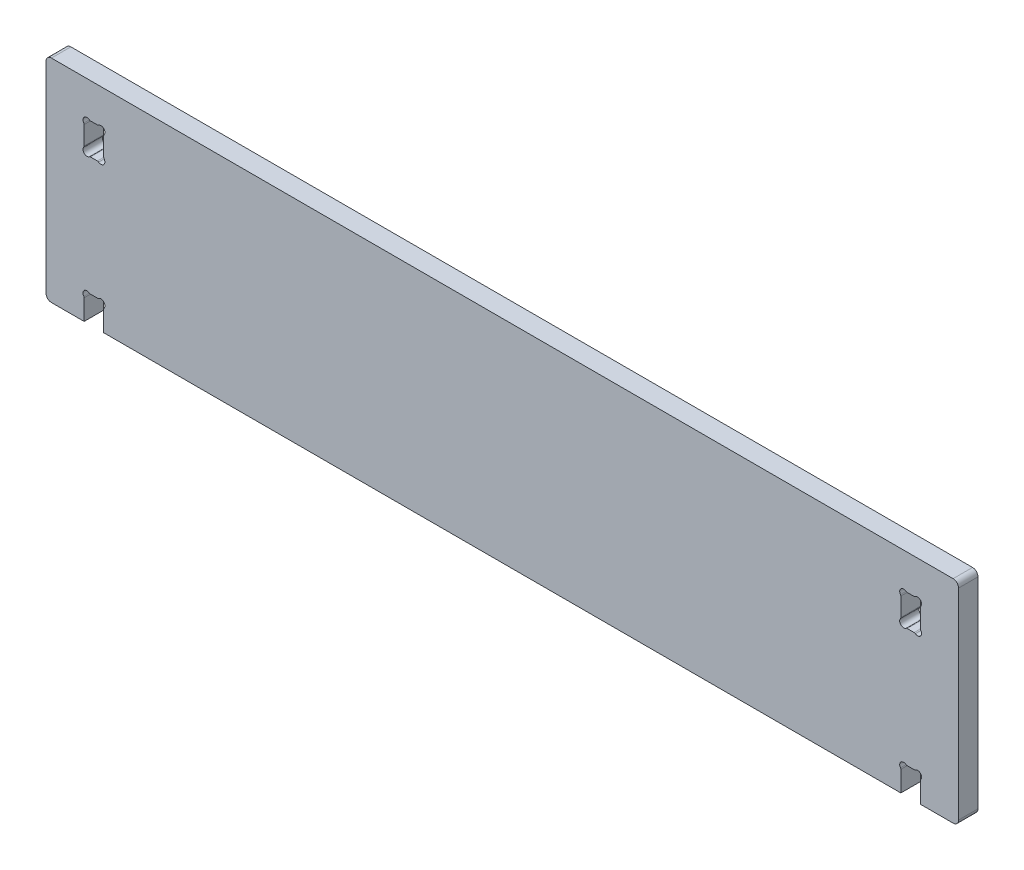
ISO-10303-21;
HEADER;
FILE_DESCRIPTION(('STEP AP214'),'2;1');
FILE_NAME('part.step','',(''),(''),'','','');
FILE_SCHEMA(('AUTOMOTIVE_DESIGN { 1 0 10303 214 1 1 1 1 }'));
ENDSEC;
DATA;
#1=APPLICATION_CONTEXT('core data for automotive mechanical design processes');
#2=APPLICATION_PROTOCOL_DEFINITION('international standard','automotive_design',2000,#1);
#3=PRODUCT_CONTEXT('',#1,'mechanical');
#4=PRODUCT('Part','Part','',(#3));
#5=PRODUCT_RELATED_PRODUCT_CATEGORY('part','',(#4));
#6=PRODUCT_DEFINITION_FORMATION('','',#4);
#7=PRODUCT_DEFINITION_CONTEXT('part definition',#1,'design');
#8=PRODUCT_DEFINITION('design','',#6,#7);
#9=PRODUCT_DEFINITION_SHAPE('','',#8);
#10=(LENGTH_UNIT() NAMED_UNIT(*) SI_UNIT(.MILLI.,.METRE.));
#11=(NAMED_UNIT(*) PLANE_ANGLE_UNIT() SI_UNIT($,.RADIAN.));
#12=(NAMED_UNIT(*) SI_UNIT($,.STERADIAN.) SOLID_ANGLE_UNIT());
#13=UNCERTAINTY_MEASURE_WITH_UNIT(LENGTH_MEASURE(1.E-05),#10,'distance_accuracy_value','');
#14=(GEOMETRIC_REPRESENTATION_CONTEXT(3) GLOBAL_UNCERTAINTY_ASSIGNED_CONTEXT((#13)) GLOBAL_UNIT_ASSIGNED_CONTEXT((#10,
#11,#12)) REPRESENTATION_CONTEXT('',''));
#15=CARTESIAN_POINT('',(0.,0.,0.));
#16=DIRECTION('',(0.,0.,1.));
#17=DIRECTION('',(1.,0.,0.));
#18=AXIS2_PLACEMENT_3D('',#15,#16,#17);
#19=CARTESIAN_POINT('',(76.7666666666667,-201.03104038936,25.));
#20=DIRECTION('',(0.,0.,-1.));
#21=DIRECTION('',(-1.,0.,0.));
#22=AXIS2_PLACEMENT_3D('',#19,#20,#21);
#23=PLANE('',#22);
#24=DIRECTION('',(0.,-1.,0.));
#25=VECTOR('',#24,1.);
#26=CARTESIAN_POINT('',(0.,-227.416666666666,25.));
#27=LINE('',#26,#25);
#28=CARTESIAN_POINT('',(0.,38.,25.));
#29=VERTEX_POINT('',#28);
#30=CARTESIAN_POINT('',(0.,-220.416666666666,25.));
#31=VERTEX_POINT('',#30);
#32=EDGE_CURVE('E797',#29,#31,#27,.T.);
#33=ORIENTED_EDGE('',*,*,#32,.T.);
#34=CARTESIAN_POINT('',(7.,-220.416666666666,25.));
#35=DIRECTION('',(0.,0.,-1.));
#36=DIRECTION('',(-1.,0.,0.));
#37=AXIS2_PLACEMENT_3D('',#34,#35,#36);
#38=CIRCLE('',#37,7.);
#39=CARTESIAN_POINT('',(7.00000000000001,-227.416666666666,25.));
#40=VERTEX_POINT('',#39);
#41=EDGE_CURVE('E41',#31,#40,#38,.F.);
#42=ORIENTED_EDGE('',*,*,#41,.T.);
#43=DIRECTION('',(1.,0.,0.));
#44=VECTOR('',#43,1.);
#45=CARTESIAN_POINT('',(49.0666666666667,-227.416666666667,25.));
#46=LINE('',#45,#44);
#47=CARTESIAN_POINT('',(49.0666666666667,-227.416666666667,25.));
#48=VERTEX_POINT('',#47);
#49=EDGE_CURVE('E772',#40,#48,#46,.T.);
#50=ORIENTED_EDGE('',*,*,#49,.T.);
#51=DIRECTION('',(0.,1.,0.));
#52=VECTOR('',#51,1.);
#53=CARTESIAN_POINT('',(49.0666666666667,-201.03104038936,25.));
#54=LINE('',#53,#52);
#55=CARTESIAN_POINT('',(49.0666666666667,-201.03104038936,25.));
#56=VERTEX_POINT('',#55);
#57=EDGE_CURVE('E774',#48,#56,#54,.T.);
#58=ORIENTED_EDGE('',*,*,#57,.T.);
#59=CARTESIAN_POINT('',(46.5666666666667,-201.03104038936,25.));
#60=DIRECTION('',(0.,0.,1.));
#61=DIRECTION('',(1.,0.,0.));
#62=AXIS2_PLACEMENT_3D('',#59,#60,#61);
#63=CIRCLE('',#62,2.5);
#64=CARTESIAN_POINT('',(48.5752997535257,-199.542620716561,25.));
#65=VERTEX_POINT('',#64);
#66=EDGE_CURVE('E777',#56,#65,#63,.T.);
#67=ORIENTED_EDGE('',*,*,#66,.T.);
#68=CARTESIAN_POINT('',(52.6729112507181,-196.506244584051,25.));
#69=DIRECTION('',(0.,0.,-1.));
#70=DIRECTION('',(-1.,0.,0.));
#71=AXIS2_PLACEMENT_3D('',#68,#69,#70);
#72=CIRCLE('',#71,5.1);
#73=CARTESIAN_POINT('',(55.7092873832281,-192.408633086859,25.));
#74=VERTEX_POINT('',#73);
#75=EDGE_CURVE('E779',#65,#74,#72,.T.);
#76=ORIENTED_EDGE('',*,*,#75,.T.);
#77=CARTESIAN_POINT('',(57.1977070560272,-190.4,25.));
#78=DIRECTION('',(0.,0.,1.));
#79=DIRECTION('',(-1.,0.,0.));
#80=AXIS2_PLACEMENT_3D('',#77,#78,#79);
#81=CIRCLE('',#80,2.49999999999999);
#82=CARTESIAN_POINT('',(57.1977070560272,-192.9,25.));
#83=VERTEX_POINT('',#82);
#84=EDGE_CURVE('E781',#74,#83,#81,.T.);
#85=ORIENTED_EDGE('',*,*,#84,.T.);
#86=DIRECTION('',(1.,0.,0.));
#87=VECTOR('',#86,1.);
#88=CARTESIAN_POINT('',(57.1977070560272,-192.9,25.));
#89=LINE('',#88,#87);
#90=CARTESIAN_POINT('',(66.1356262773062,-192.9,25.));
#91=VERTEX_POINT('',#90);
#92=EDGE_CURVE('E783',#83,#91,#89,.T.);
#93=ORIENTED_EDGE('',*,*,#92,.T.);
#94=CARTESIAN_POINT('',(66.1356262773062,-190.4,25.));
#95=DIRECTION('',(0.,0.,1.));
#96=DIRECTION('',(1.,0.,0.));
#97=AXIS2_PLACEMENT_3D('',#94,#95,#96);
#98=CIRCLE('',#97,2.49999999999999);
#99=CARTESIAN_POINT('',(67.6240459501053,-192.408633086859,25.));
#100=VERTEX_POINT('',#99);
#101=EDGE_CURVE('E785',#91,#100,#98,.T.);
#102=ORIENTED_EDGE('',*,*,#101,.T.);
#103=CARTESIAN_POINT('',(70.6604220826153,-196.506244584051,25.));
#104=DIRECTION('',(0.,0.,-1.));
#105=DIRECTION('',(1.,0.,0.));
#106=AXIS2_PLACEMENT_3D('',#103,#104,#105);
#107=CIRCLE('',#106,5.1);
#108=CARTESIAN_POINT('',(74.7580335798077,-199.542620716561,25.));
#109=VERTEX_POINT('',#108);
#110=EDGE_CURVE('E787',#100,#109,#107,.T.);
#111=ORIENTED_EDGE('',*,*,#110,.T.);
#112=CARTESIAN_POINT('',(76.7666666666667,-201.03104038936,25.));
#113=DIRECTION('',(0.,0.,1.));
#114=DIRECTION('',(-1.,0.,0.));
#115=AXIS2_PLACEMENT_3D('',#112,#113,#114);
#116=CIRCLE('',#115,2.5);
#117=CARTESIAN_POINT('',(74.2666666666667,-201.03104038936,25.));
#118=VERTEX_POINT('',#117);
#119=EDGE_CURVE('E789',#109,#118,#116,.T.);
#120=ORIENTED_EDGE('',*,*,#119,.T.);
#121=DIRECTION('',(0.,-1.,0.));
#122=VECTOR('',#121,1.);
#123=CARTESIAN_POINT('',(74.2666666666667,-201.03104038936,25.));
#124=LINE('',#123,#122);
#125=CARTESIAN_POINT('',(74.2666666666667,-227.416666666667,25.));
#126=VERTEX_POINT('',#125);
#127=EDGE_CURVE('E791',#118,#126,#124,.T.);
#128=ORIENTED_EDGE('',*,*,#127,.T.);
#129=DIRECTION('',(1.,0.,0.));
#130=VECTOR('',#129,1.);
#131=CARTESIAN_POINT('',(587.,-227.416666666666,25.));
#132=LINE('',#131,#130);
#133=CARTESIAN_POINT('',(1099.73333333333,-227.416666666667,25.));
#134=VERTEX_POINT('',#133);
#135=EDGE_CURVE('E793',#126,#134,#132,.T.);
#136=ORIENTED_EDGE('',*,*,#135,.T.);
#137=DIRECTION('',(0.,-1.,0.));
#138=VECTOR('',#137,1.);
#139=CARTESIAN_POINT('',(1099.73333333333,-201.03104038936,25.));
#140=LINE('',#139,#138);
#141=CARTESIAN_POINT('',(1099.73333333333,-201.03104038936,25.));
#142=VERTEX_POINT('',#141);
#143=EDGE_CURVE('E577',#142,#134,#140,.T.);
#144=ORIENTED_EDGE('',*,*,#143,.F.);
#145=CARTESIAN_POINT('',(1097.23333333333,-201.03104038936,25.));
#146=DIRECTION('',(0.,0.,-1.));
#147=DIRECTION('',(1.,0.,0.));
#148=AXIS2_PLACEMENT_3D('',#145,#146,#147);
#149=CIRCLE('',#148,2.5);
#150=CARTESIAN_POINT('',(1099.24196642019,-199.542620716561,25.));
#151=VERTEX_POINT('',#150);
#152=EDGE_CURVE('E574',#151,#142,#149,.T.);
#153=ORIENTED_EDGE('',*,*,#152,.F.);
#154=CARTESIAN_POINT('',(1103.33957791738,-196.506244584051,25.));
#155=DIRECTION('',(0.,0.,1.));
#156=DIRECTION('',(-1.,0.,0.));
#157=AXIS2_PLACEMENT_3D('',#154,#155,#156);
#158=CIRCLE('',#157,5.1);
#159=CARTESIAN_POINT('',(1106.37595404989,-192.408633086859,25.));
#160=VERTEX_POINT('',#159);
#161=EDGE_CURVE('E571',#160,#151,#158,.T.);
#162=ORIENTED_EDGE('',*,*,#161,.F.);
#163=CARTESIAN_POINT('',(1107.86437372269,-190.4,25.));
#164=DIRECTION('',(0.,0.,-1.));
#165=DIRECTION('',(-1.,0.,0.));
#166=AXIS2_PLACEMENT_3D('',#163,#164,#165);
#167=CIRCLE('',#166,2.49999999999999);
#168=CARTESIAN_POINT('',(1107.86437372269,-192.9,25.));
#169=VERTEX_POINT('',#168);
#170=EDGE_CURVE('E568',#169,#160,#167,.T.);
#171=ORIENTED_EDGE('',*,*,#170,.F.);
#172=DIRECTION('',(-1.,0.,0.));
#173=VECTOR('',#172,1.);
#174=CARTESIAN_POINT('',(1116.80229294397,-192.9,25.));
#175=LINE('',#174,#173);
#176=CARTESIAN_POINT('',(1116.80229294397,-192.9,25.));
#177=VERTEX_POINT('',#176);
#178=EDGE_CURVE('E565',#177,#169,#175,.T.);
#179=ORIENTED_EDGE('',*,*,#178,.F.);
#180=CARTESIAN_POINT('',(1116.80229294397,-190.4,25.));
#181=DIRECTION('',(0.,0.,-1.));
#182=DIRECTION('',(1.,0.,0.));
#183=AXIS2_PLACEMENT_3D('',#180,#181,#182);
#184=CIRCLE('',#183,2.49999999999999);
#185=CARTESIAN_POINT('',(1118.29071261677,-192.408633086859,25.));
#186=VERTEX_POINT('',#185);
#187=EDGE_CURVE('E562',#186,#177,#184,.T.);
#188=ORIENTED_EDGE('',*,*,#187,.F.);
#189=CARTESIAN_POINT('',(1121.32708874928,-196.506244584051,25.));
#190=DIRECTION('',(0.,0.,1.));
#191=DIRECTION('',(1.,0.,0.));
#192=AXIS2_PLACEMENT_3D('',#189,#190,#191);
#193=CIRCLE('',#192,5.1);
#194=CARTESIAN_POINT('',(1125.42470024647,-199.542620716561,25.));
#195=VERTEX_POINT('',#194);
#196=EDGE_CURVE('E559',#195,#186,#193,.T.);
#197=ORIENTED_EDGE('',*,*,#196,.F.);
#198=CARTESIAN_POINT('',(1127.43333333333,-201.03104038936,25.));
#199=DIRECTION('',(0.,0.,-1.));
#200=DIRECTION('',(-1.,0.,0.));
#201=AXIS2_PLACEMENT_3D('',#198,#199,#200);
#202=CIRCLE('',#201,2.5);
#203=CARTESIAN_POINT('',(1124.93333333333,-201.03104038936,25.));
#204=VERTEX_POINT('',#203);
#205=EDGE_CURVE('E556',#204,#195,#202,.T.);
#206=ORIENTED_EDGE('',*,*,#205,.F.);
#207=DIRECTION('',(0.,1.,0.));
#208=VECTOR('',#207,1.);
#209=CARTESIAN_POINT('',(1124.93333333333,-201.03104038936,25.));
#210=LINE('',#209,#208);
#211=CARTESIAN_POINT('',(1124.93333333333,-227.416666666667,25.));
#212=VERTEX_POINT('',#211);
#213=EDGE_CURVE('E552',#212,#204,#210,.T.);
#214=ORIENTED_EDGE('',*,*,#213,.F.);
#215=DIRECTION('',(-1.,0.,0.));
#216=VECTOR('',#215,1.);
#217=CARTESIAN_POINT('',(1124.93333333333,-227.416666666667,25.));
#218=LINE('',#217,#216);
#219=CARTESIAN_POINT('',(1167.,-227.416666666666,25.));
#220=VERTEX_POINT('',#219);
#221=EDGE_CURVE('E549',#220,#212,#218,.T.);
#222=ORIENTED_EDGE('',*,*,#221,.F.);
#223=CARTESIAN_POINT('',(1167.,-220.416666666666,25.));
#224=DIRECTION('',(0.,0.,1.));
#225=DIRECTION('',(1.,0.,0.));
#226=AXIS2_PLACEMENT_3D('',#223,#224,#225);
#227=CIRCLE('',#226,7.);
#228=CARTESIAN_POINT('',(1174.,-220.416666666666,25.));
#229=VERTEX_POINT('',#228);
#230=EDGE_CURVE('E650',#229,#220,#227,.F.);
#231=ORIENTED_EDGE('',*,*,#230,.F.);
#232=DIRECTION('',(0.,-1.,0.));
#233=VECTOR('',#232,1.);
#234=CARTESIAN_POINT('',(1174.,-227.416666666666,25.));
#235=LINE('',#234,#233);
#236=CARTESIAN_POINT('',(1174.,38.,25.));
#237=VERTEX_POINT('',#236);
#238=EDGE_CURVE('E580',#237,#229,#235,.T.);
#239=ORIENTED_EDGE('',*,*,#238,.F.);
#240=CARTESIAN_POINT('',(1167.,38.,25.));
#241=DIRECTION('',(0.,0.,1.));
#242=DIRECTION('',(1.,0.,0.));
#243=AXIS2_PLACEMENT_3D('',#240,#241,#242);
#244=CIRCLE('',#243,7.);
#245=CARTESIAN_POINT('',(1167.,45.,25.));
#246=VERTEX_POINT('',#245);
#247=EDGE_CURVE('E647',#246,#237,#244,.F.);
#248=ORIENTED_EDGE('',*,*,#247,.F.);
#249=DIRECTION('',(-1.,0.,0.));
#250=VECTOR('',#249,1.);
#251=CARTESIAN_POINT('',(0.,45.,25.));
#252=LINE('',#251,#250);
#253=CARTESIAN_POINT('',(7.,45.,25.));
#254=VERTEX_POINT('',#253);
#255=EDGE_CURVE('E795',#246,#254,#252,.T.);
#256=ORIENTED_EDGE('',*,*,#255,.T.);
#257=CARTESIAN_POINT('',(7.,38.,25.));
#258=DIRECTION('',(0.,0.,-1.));
#259=DIRECTION('',(-1.,0.,0.));
#260=AXIS2_PLACEMENT_3D('',#257,#258,#259);
#261=CIRCLE('',#260,7.);
#262=EDGE_CURVE('E864',#254,#29,#261,.F.);
#263=ORIENTED_EDGE('',*,*,#262,.T.);
#264=EDGE_LOOP('',(#33,#42,#50,#58,#67,#76,#85,#93,#102,#111,#120,#128,#136,#144,#153,#162,#171,
#179,#188,#197,#206,#214,#222,#231,#239,#248,#256,#263));
#265=FACE_BOUND('',#264,.T.);
#266=CARTESIAN_POINT('',(57.1977070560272,2.6,25.));
#267=DIRECTION('',(0.,0.,-1.));
#268=DIRECTION('',(1.,0.,0.));
#269=AXIS2_PLACEMENT_3D('',#266,#267,#268);
#270=CIRCLE('',#269,2.49999999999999);
#271=CARTESIAN_POINT('',(57.1977070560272,0.099999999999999,25.));
#272=VERTEX_POINT('',#271);
#273=CARTESIAN_POINT('',(55.7092873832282,0.591366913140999,25.));
#274=VERTEX_POINT('',#273);
#275=EDGE_CURVE('E657',#272,#274,#270,.T.);
#276=ORIENTED_EDGE('',*,*,#275,.F.);
#277=DIRECTION('',(-1.,0.,0.));
#278=VECTOR('',#277,1.);
#279=CARTESIAN_POINT('',(66.1356262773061,0.1,25.));
#280=LINE('',#279,#278);
#281=CARTESIAN_POINT('',(66.1356262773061,0.0999999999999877,25.));
#282=VERTEX_POINT('',#281);
#283=EDGE_CURVE('E689',#282,#272,#280,.T.);
#284=ORIENTED_EDGE('',*,*,#283,.F.);
#285=CARTESIAN_POINT('',(66.1356262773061,2.6,25.));
#286=DIRECTION('',(0.,0.,-1.));
#287=DIRECTION('',(-1.,0.,0.));
#288=AXIS2_PLACEMENT_3D('',#285,#286,#287);
#289=CIRCLE('',#288,2.5);
#290=CARTESIAN_POINT('',(67.6240459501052,0.591366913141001,25.));
#291=VERTEX_POINT('',#290);
#292=EDGE_CURVE('E686',#291,#282,#289,.T.);
#293=ORIENTED_EDGE('',*,*,#292,.F.);
#294=CARTESIAN_POINT('',(70.6604220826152,-3.50624458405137,25.));
#295=DIRECTION('',(0.,0.,1.));
#296=DIRECTION('',(-1.,0.,0.));
#297=AXIS2_PLACEMENT_3D('',#294,#295,#296);
#298=CIRCLE('',#297,5.1);
#299=CARTESIAN_POINT('',(74.7580335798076,-6.54262071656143,25.));
#300=VERTEX_POINT('',#299);
#301=EDGE_CURVE('E684',#300,#291,#298,.T.);
#302=ORIENTED_EDGE('',*,*,#301,.F.);
#303=CARTESIAN_POINT('',(76.7666666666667,-8.03104038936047,25.));
#304=DIRECTION('',(0.,0.,-1.));
#305=DIRECTION('',(1.,0.,0.));
#306=AXIS2_PLACEMENT_3D('',#303,#304,#305);
#307=CIRCLE('',#306,2.5);
#308=CARTESIAN_POINT('',(74.2666666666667,-8.03104038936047,25.));
#309=VERTEX_POINT('',#308);
#310=EDGE_CURVE('E682',#309,#300,#307,.T.);
#311=ORIENTED_EDGE('',*,*,#310,.F.);
#312=DIRECTION('',(0.,1.,0.));
#313=VECTOR('',#312,1.);
#314=CARTESIAN_POINT('',(74.2666666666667,-8.03104038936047,25.));
#315=LINE('',#314,#313);
#316=CARTESIAN_POINT('',(74.2666666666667,-31.9689596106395,25.));
#317=VERTEX_POINT('',#316);
#318=EDGE_CURVE('E680',#317,#309,#315,.T.);
#319=ORIENTED_EDGE('',*,*,#318,.F.);
#320=CARTESIAN_POINT('',(76.7666666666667,-31.9689596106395,25.));
#321=DIRECTION('',(0.,0.,-1.));
#322=DIRECTION('',(-1.,0.,0.));
#323=AXIS2_PLACEMENT_3D('',#320,#321,#322);
#324=CIRCLE('',#323,2.5);
#325=CARTESIAN_POINT('',(74.7580335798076,-33.4573792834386,25.));
#326=VERTEX_POINT('',#325);
#327=EDGE_CURVE('E678',#326,#317,#324,.T.);
#328=ORIENTED_EDGE('',*,*,#327,.F.);
#329=CARTESIAN_POINT('',(70.6604220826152,-36.4937554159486,25.));
#330=DIRECTION('',(0.,0.,1.));
#331=DIRECTION('',(1.,0.,0.));
#332=AXIS2_PLACEMENT_3D('',#329,#330,#331);
#333=CIRCLE('',#332,5.1);
#334=CARTESIAN_POINT('',(67.6240459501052,-40.591366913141,25.));
#335=VERTEX_POINT('',#334);
#336=EDGE_CURVE('E676',#335,#326,#333,.T.);
#337=ORIENTED_EDGE('',*,*,#336,.F.);
#338=CARTESIAN_POINT('',(66.1356262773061,-42.6,25.));
#339=DIRECTION('',(0.,0.,-1.));
#340=DIRECTION('',(1.,0.,0.));
#341=AXIS2_PLACEMENT_3D('',#338,#339,#340);
#342=CIRCLE('',#341,2.5);
#343=CARTESIAN_POINT('',(66.1356262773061,-40.1,25.));
#344=VERTEX_POINT('',#343);
#345=EDGE_CURVE('E674',#344,#335,#342,.T.);
#346=ORIENTED_EDGE('',*,*,#345,.F.);
#347=DIRECTION('',(1.,0.,0.));
#348=VECTOR('',#347,1.);
#349=CARTESIAN_POINT('',(66.1356262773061,-40.1,25.));
#350=LINE('',#349,#348);
#351=CARTESIAN_POINT('',(57.1977070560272,-40.1,25.));
#352=VERTEX_POINT('',#351);
#353=EDGE_CURVE('E672',#352,#344,#350,.T.);
#354=ORIENTED_EDGE('',*,*,#353,.F.);
#355=CARTESIAN_POINT('',(57.1977070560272,-42.6,25.));
#356=DIRECTION('',(0.,0.,-1.));
#357=DIRECTION('',(-1.,0.,0.));
#358=AXIS2_PLACEMENT_3D('',#355,#356,#357);
#359=CIRCLE('',#358,2.5);
#360=CARTESIAN_POINT('',(55.7092873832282,-40.591366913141,25.));
#361=VERTEX_POINT('',#360);
#362=EDGE_CURVE('E670',#361,#352,#359,.T.);
#363=ORIENTED_EDGE('',*,*,#362,.F.);
#364=CARTESIAN_POINT('',(52.6729112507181,-36.4937554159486,25.));
#365=DIRECTION('',(0.,0.,1.));
#366=DIRECTION('',(-1.,0.,0.));
#367=AXIS2_PLACEMENT_3D('',#364,#365,#366);
#368=CIRCLE('',#367,5.1);
#369=CARTESIAN_POINT('',(48.5752997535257,-33.4573792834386,25.));
#370=VERTEX_POINT('',#369);
#371=EDGE_CURVE('E668',#370,#361,#368,.T.);
#372=ORIENTED_EDGE('',*,*,#371,.F.);
#373=CARTESIAN_POINT('',(46.5666666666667,-31.9689596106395,25.));
#374=DIRECTION('',(0.,0.,-1.));
#375=DIRECTION('',(1.,0.,0.));
#376=AXIS2_PLACEMENT_3D('',#373,#374,#375);
#377=CIRCLE('',#376,2.5);
#378=CARTESIAN_POINT('',(49.0666666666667,-31.9689596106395,25.));
#379=VERTEX_POINT('',#378);
#380=EDGE_CURVE('E666',#379,#370,#377,.T.);
#381=ORIENTED_EDGE('',*,*,#380,.F.);
#382=DIRECTION('',(0.,-1.,0.));
#383=VECTOR('',#382,1.);
#384=CARTESIAN_POINT('',(49.0666666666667,-8.03104038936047,25.));
#385=LINE('',#384,#383);
#386=CARTESIAN_POINT('',(49.0666666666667,-8.03104038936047,25.));
#387=VERTEX_POINT('',#386);
#388=EDGE_CURVE('E664',#387,#379,#385,.T.);
#389=ORIENTED_EDGE('',*,*,#388,.F.);
#390=CARTESIAN_POINT('',(46.5666666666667,-8.03104038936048,25.));
#391=DIRECTION('',(0.,0.,-1.));
#392=DIRECTION('',(-1.,0.,0.));
#393=AXIS2_PLACEMENT_3D('',#390,#391,#392);
#394=CIRCLE('',#393,2.5);
#395=CARTESIAN_POINT('',(48.5752997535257,-6.54262071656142,25.));
#396=VERTEX_POINT('',#395);
#397=EDGE_CURVE('E662',#396,#387,#394,.T.);
#398=ORIENTED_EDGE('',*,*,#397,.F.);
#399=CARTESIAN_POINT('',(52.6729112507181,-3.50624458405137,25.));
#400=DIRECTION('',(0.,0.,1.));
#401=DIRECTION('',(1.,0.,0.));
#402=AXIS2_PLACEMENT_3D('',#399,#400,#401);
#403=CIRCLE('',#402,5.1);
#404=EDGE_CURVE('E659',#274,#396,#403,.T.);
#405=ORIENTED_EDGE('',*,*,#404,.F.);
#406=EDGE_LOOP('',(#276,#284,#293,#302,#311,#319,#328,#337,#346,#354,#363,#372,#381,#389,#398,#405));
#407=FACE_BOUND('',#406,.T.);
#408=CARTESIAN_POINT('',(1116.80229294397,2.6,25.));
#409=DIRECTION('',(0.,0.,1.));
#410=DIRECTION('',(-1.,0.,0.));
#411=AXIS2_PLACEMENT_3D('',#408,#409,#410);
#412=CIRCLE('',#411,2.49999999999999);
#413=CARTESIAN_POINT('',(1116.80229294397,0.099999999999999,25.));
#414=VERTEX_POINT('',#413);
#415=CARTESIAN_POINT('',(1118.29071261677,0.591366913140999,25.));
#416=VERTEX_POINT('',#415);
#417=EDGE_CURVE('E415',#414,#416,#412,.T.);
#418=ORIENTED_EDGE('',*,*,#417,.T.);
#419=CARTESIAN_POINT('',(1121.32708874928,-3.50624458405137,25.));
#420=DIRECTION('',(0.,0.,-1.));
#421=DIRECTION('',(-1.,0.,0.));
#422=AXIS2_PLACEMENT_3D('',#419,#420,#421);
#423=CIRCLE('',#422,5.1);
#424=CARTESIAN_POINT('',(1125.42470024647,-6.54262071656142,25.));
#425=VERTEX_POINT('',#424);
#426=EDGE_CURVE('E425',#416,#425,#423,.T.);
#427=ORIENTED_EDGE('',*,*,#426,.T.);
#428=CARTESIAN_POINT('',(1127.43333333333,-8.03104038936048,25.));
#429=DIRECTION('',(0.,0.,1.));
#430=DIRECTION('',(1.,0.,0.));
#431=AXIS2_PLACEMENT_3D('',#428,#429,#430);
#432=CIRCLE('',#431,2.5);
#433=CARTESIAN_POINT('',(1124.93333333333,-8.03104038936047,25.));
#434=VERTEX_POINT('',#433);
#435=EDGE_CURVE('E430',#425,#434,#432,.T.);
#436=ORIENTED_EDGE('',*,*,#435,.T.);
#437=DIRECTION('',(0.,-1.,0.));
#438=VECTOR('',#437,1.);
#439=CARTESIAN_POINT('',(1124.93333333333,-8.03104038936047,25.));
#440=LINE('',#439,#438);
#441=CARTESIAN_POINT('',(1124.93333333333,-31.9689596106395,25.));
#442=VERTEX_POINT('',#441);
#443=EDGE_CURVE('E443',#434,#442,#440,.T.);
#444=ORIENTED_EDGE('',*,*,#443,.T.);
#445=CARTESIAN_POINT('',(1127.43333333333,-31.9689596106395,25.));
#446=DIRECTION('',(0.,0.,1.));
#447=DIRECTION('',(-1.,0.,0.));
#448=AXIS2_PLACEMENT_3D('',#445,#446,#447);
#449=CIRCLE('',#448,2.5);
#450=CARTESIAN_POINT('',(1125.42470024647,-33.4573792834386,25.));
#451=VERTEX_POINT('',#450);
#452=EDGE_CURVE('E446',#442,#451,#449,.T.);
#453=ORIENTED_EDGE('',*,*,#452,.T.);
#454=CARTESIAN_POINT('',(1121.32708874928,-36.4937554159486,25.));
#455=DIRECTION('',(0.,0.,-1.));
#456=DIRECTION('',(1.,0.,0.));
#457=AXIS2_PLACEMENT_3D('',#454,#455,#456);
#458=CIRCLE('',#457,5.1);
#459=CARTESIAN_POINT('',(1118.29071261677,-40.591366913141,25.));
#460=VERTEX_POINT('',#459);
#461=EDGE_CURVE('E449',#451,#460,#458,.T.);
#462=ORIENTED_EDGE('',*,*,#461,.T.);
#463=CARTESIAN_POINT('',(1116.80229294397,-42.6,25.));
#464=DIRECTION('',(0.,0.,1.));
#465=DIRECTION('',(1.,0.,0.));
#466=AXIS2_PLACEMENT_3D('',#463,#464,#465);
#467=CIRCLE('',#466,2.5);
#468=CARTESIAN_POINT('',(1116.80229294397,-40.1,25.));
#469=VERTEX_POINT('',#468);
#470=EDGE_CURVE('E452',#460,#469,#467,.T.);
#471=ORIENTED_EDGE('',*,*,#470,.T.);
#472=DIRECTION('',(-1.,0.,0.));
#473=VECTOR('',#472,1.);
#474=CARTESIAN_POINT('',(1107.86437372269,-40.1,25.));
#475=LINE('',#474,#473);
#476=CARTESIAN_POINT('',(1107.86437372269,-40.1,25.));
#477=VERTEX_POINT('',#476);
#478=EDGE_CURVE('E455',#469,#477,#475,.T.);
#479=ORIENTED_EDGE('',*,*,#478,.T.);
#480=CARTESIAN_POINT('',(1107.86437372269,-42.6,25.));
#481=DIRECTION('',(0.,0.,1.));
#482=DIRECTION('',(-1.,0.,0.));
#483=AXIS2_PLACEMENT_3D('',#480,#481,#482);
#484=CIRCLE('',#483,2.5);
#485=CARTESIAN_POINT('',(1106.37595404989,-40.591366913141,25.));
#486=VERTEX_POINT('',#485);
#487=EDGE_CURVE('E458',#477,#486,#484,.T.);
#488=ORIENTED_EDGE('',*,*,#487,.T.);
#489=CARTESIAN_POINT('',(1103.33957791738,-36.4937554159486,25.));
#490=DIRECTION('',(0.,0.,-1.));
#491=DIRECTION('',(-1.,0.,0.));
#492=AXIS2_PLACEMENT_3D('',#489,#490,#491);
#493=CIRCLE('',#492,5.1);
#494=CARTESIAN_POINT('',(1099.24196642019,-33.4573792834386,25.));
#495=VERTEX_POINT('',#494);
#496=EDGE_CURVE('E461',#486,#495,#493,.T.);
#497=ORIENTED_EDGE('',*,*,#496,.T.);
#498=CARTESIAN_POINT('',(1097.23333333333,-31.9689596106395,25.));
#499=DIRECTION('',(0.,0.,1.));
#500=DIRECTION('',(1.,0.,0.));
#501=AXIS2_PLACEMENT_3D('',#498,#499,#500);
#502=CIRCLE('',#501,2.5);
#503=CARTESIAN_POINT('',(1099.73333333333,-31.9689596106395,25.));
#504=VERTEX_POINT('',#503);
#505=EDGE_CURVE('E464',#495,#504,#502,.T.);
#506=ORIENTED_EDGE('',*,*,#505,.T.);
#507=DIRECTION('',(0.,1.,0.));
#508=VECTOR('',#507,1.);
#509=CARTESIAN_POINT('',(1099.73333333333,-8.03104038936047,25.));
#510=LINE('',#509,#508);
#511=CARTESIAN_POINT('',(1099.73333333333,-8.03104038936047,25.));
#512=VERTEX_POINT('',#511);
#513=EDGE_CURVE('E467',#504,#512,#510,.T.);
#514=ORIENTED_EDGE('',*,*,#513,.T.);
#515=CARTESIAN_POINT('',(1097.23333333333,-8.03104038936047,25.));
#516=DIRECTION('',(0.,0.,1.));
#517=DIRECTION('',(-1.,0.,0.));
#518=AXIS2_PLACEMENT_3D('',#515,#516,#517);
#519=CIRCLE('',#518,2.5);
#520=CARTESIAN_POINT('',(1099.24196642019,-6.54262071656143,25.));
#521=VERTEX_POINT('',#520);
#522=EDGE_CURVE('E470',#512,#521,#519,.T.);
#523=ORIENTED_EDGE('',*,*,#522,.T.);
#524=CARTESIAN_POINT('',(1103.33957791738,-3.50624458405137,25.));
#525=DIRECTION('',(0.,0.,-1.));
#526=DIRECTION('',(1.,0.,0.));
#527=AXIS2_PLACEMENT_3D('',#524,#525,#526);
#528=CIRCLE('',#527,5.1);
#529=CARTESIAN_POINT('',(1106.37595404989,0.591366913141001,25.));
#530=VERTEX_POINT('',#529);
#531=EDGE_CURVE('E473',#521,#530,#528,.T.);
#532=ORIENTED_EDGE('',*,*,#531,.T.);
#533=CARTESIAN_POINT('',(1107.86437372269,2.6,25.));
#534=DIRECTION('',(0.,0.,1.));
#535=DIRECTION('',(1.,0.,0.));
#536=AXIS2_PLACEMENT_3D('',#533,#534,#535);
#537=CIRCLE('',#536,2.5);
#538=CARTESIAN_POINT('',(1107.86437372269,0.0999999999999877,25.));
#539=VERTEX_POINT('',#538);
#540=EDGE_CURVE('E476',#530,#539,#537,.T.);
#541=ORIENTED_EDGE('',*,*,#540,.T.);
#542=DIRECTION('',(1.,0.,0.));
#543=VECTOR('',#542,1.);
#544=CARTESIAN_POINT('',(1107.86437372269,0.1,25.));
#545=LINE('',#544,#543);
#546=EDGE_CURVE('E435',#539,#414,#545,.T.);
#547=ORIENTED_EDGE('',*,*,#546,.T.);
#548=EDGE_LOOP('',(#418,#427,#436,#444,#453,#462,#471,#479,#488,#497,#506,#514,#523,#532,#541,#547));
#549=FACE_BOUND('',#548,.T.);
#550=ADVANCED_FACE('F33',(#265,#407,#549),#23,.F.);
#551=CARTESIAN_POINT('',(76.7666666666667,-201.03104038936,0.));
#552=DIRECTION('',(0.,0.,-1.));
#553=DIRECTION('',(-1.,0.,0.));
#554=AXIS2_PLACEMENT_3D('',#551,#552,#553);
#555=PLANE('',#554);
#556=DIRECTION('',(1.,0.,0.));
#557=VECTOR('',#556,1.);
#558=CARTESIAN_POINT('',(49.0666666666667,-227.416666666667,0.));
#559=LINE('',#558,#557);
#560=CARTESIAN_POINT('',(7.00000000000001,-227.416666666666,0.));
#561=VERTEX_POINT('',#560);
#562=CARTESIAN_POINT('',(49.0666666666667,-227.416666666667,0.));
#563=VERTEX_POINT('',#562);
#564=EDGE_CURVE('E771',#561,#563,#559,.T.);
#565=ORIENTED_EDGE('',*,*,#564,.F.);
#566=CARTESIAN_POINT('',(7.,-220.416666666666,0.));
#567=DIRECTION('',(0.,0.,-1.));
#568=DIRECTION('',(-1.,0.,0.));
#569=AXIS2_PLACEMENT_3D('',#566,#567,#568);
#570=CIRCLE('',#569,7.);
#571=CARTESIAN_POINT('',(0.,-220.416666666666,0.));
#572=VERTEX_POINT('',#571);
#573=EDGE_CURVE('E858',#561,#572,#570,.T.);
#574=ORIENTED_EDGE('',*,*,#573,.T.);
#575=DIRECTION('',(0.,-1.,0.));
#576=VECTOR('',#575,1.);
#577=CARTESIAN_POINT('',(0.,-227.416666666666,0.));
#578=LINE('',#577,#576);
#579=CARTESIAN_POINT('',(0.,38.,0.));
#580=VERTEX_POINT('',#579);
#581=EDGE_CURVE('E775',#580,#572,#578,.T.);
#582=ORIENTED_EDGE('',*,*,#581,.F.);
#583=CARTESIAN_POINT('',(7.,38.,0.));
#584=DIRECTION('',(0.,0.,-1.));
#585=DIRECTION('',(-1.,0.,0.));
#586=AXIS2_PLACEMENT_3D('',#583,#584,#585);
#587=CIRCLE('',#586,7.);
#588=CARTESIAN_POINT('',(7.,45.,0.));
#589=VERTEX_POINT('',#588);
#590=EDGE_CURVE('E856',#580,#589,#587,.T.);
#591=ORIENTED_EDGE('',*,*,#590,.T.);
#592=DIRECTION('',(-1.,0.,0.));
#593=VECTOR('',#592,1.);
#594=CARTESIAN_POINT('',(0.,45.,0.));
#595=LINE('',#594,#593);
#596=CARTESIAN_POINT('',(1167.,45.,0.));
#597=VERTEX_POINT('',#596);
#598=EDGE_CURVE('E821',#597,#589,#595,.T.);
#599=ORIENTED_EDGE('',*,*,#598,.F.);
#600=CARTESIAN_POINT('',(1167.,38.,0.));
#601=DIRECTION('',(0.,0.,1.));
#602=DIRECTION('',(1.,0.,0.));
#603=AXIS2_PLACEMENT_3D('',#600,#601,#602);
#604=CIRCLE('',#603,7.);
#605=CARTESIAN_POINT('',(1174.,38.,0.));
#606=VERTEX_POINT('',#605);
#607=EDGE_CURVE('E637',#606,#597,#604,.T.);
#608=ORIENTED_EDGE('',*,*,#607,.F.);
#609=DIRECTION('',(0.,-1.,0.));
#610=VECTOR('',#609,1.);
#611=CARTESIAN_POINT('',(1174.,-227.416666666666,0.));
#612=LINE('',#611,#610);
#613=CARTESIAN_POINT('',(1174.,-220.416666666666,0.));
#614=VERTEX_POINT('',#613);
#615=EDGE_CURVE('E553',#606,#614,#612,.T.);
#616=ORIENTED_EDGE('',*,*,#615,.T.);
#617=CARTESIAN_POINT('',(1167.,-220.416666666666,0.));
#618=DIRECTION('',(0.,0.,1.));
#619=DIRECTION('',(1.,0.,0.));
#620=AXIS2_PLACEMENT_3D('',#617,#618,#619);
#621=CIRCLE('',#620,7.);
#622=CARTESIAN_POINT('',(1167.,-227.416666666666,0.));
#623=VERTEX_POINT('',#622);
#624=EDGE_CURVE('E640',#623,#614,#621,.T.);
#625=ORIENTED_EDGE('',*,*,#624,.F.);
#626=DIRECTION('',(-1.,0.,0.));
#627=VECTOR('',#626,1.);
#628=CARTESIAN_POINT('',(1124.93333333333,-227.416666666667,0.));
#629=LINE('',#628,#627);
#630=CARTESIAN_POINT('',(1124.93333333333,-227.416666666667,0.));
#631=VERTEX_POINT('',#630);
#632=EDGE_CURVE('E421',#623,#631,#629,.T.);
#633=ORIENTED_EDGE('',*,*,#632,.T.);
#634=DIRECTION('',(0.,1.,0.));
#635=VECTOR('',#634,1.);
#636=CARTESIAN_POINT('',(1124.93333333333,-201.03104038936,0.));
#637=LINE('',#636,#635);
#638=CARTESIAN_POINT('',(1124.93333333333,-201.03104038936,0.));
#639=VERTEX_POINT('',#638);
#640=EDGE_CURVE('E586',#631,#639,#637,.T.);
#641=ORIENTED_EDGE('',*,*,#640,.T.);
#642=CARTESIAN_POINT('',(1127.43333333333,-201.03104038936,0.));
#643=DIRECTION('',(0.,0.,-1.));
#644=DIRECTION('',(-1.,0.,0.));
#645=AXIS2_PLACEMENT_3D('',#642,#643,#644);
#646=CIRCLE('',#645,2.5);
#647=CARTESIAN_POINT('',(1125.42470024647,-199.542620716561,0.));
#648=VERTEX_POINT('',#647);
#649=EDGE_CURVE('E589',#639,#648,#646,.T.);
#650=ORIENTED_EDGE('',*,*,#649,.T.);
#651=CARTESIAN_POINT('',(1121.32708874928,-196.506244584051,0.));
#652=DIRECTION('',(0.,0.,1.));
#653=DIRECTION('',(1.,0.,0.));
#654=AXIS2_PLACEMENT_3D('',#651,#652,#653);
#655=CIRCLE('',#654,5.1);
#656=CARTESIAN_POINT('',(1118.29071261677,-192.408633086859,0.));
#657=VERTEX_POINT('',#656);
#658=EDGE_CURVE('E592',#648,#657,#655,.T.);
#659=ORIENTED_EDGE('',*,*,#658,.T.);
#660=CARTESIAN_POINT('',(1116.80229294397,-190.4,0.));
#661=DIRECTION('',(0.,0.,-1.));
#662=DIRECTION('',(1.,0.,0.));
#663=AXIS2_PLACEMENT_3D('',#660,#661,#662);
#664=CIRCLE('',#663,2.49999999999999);
#665=CARTESIAN_POINT('',(1116.80229294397,-192.9,0.));
#666=VERTEX_POINT('',#665);
#667=EDGE_CURVE('E595',#657,#666,#664,.T.);
#668=ORIENTED_EDGE('',*,*,#667,.T.);
#669=DIRECTION('',(-1.,0.,0.));
#670=VECTOR('',#669,1.);
#671=CARTESIAN_POINT('',(1116.80229294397,-192.9,0.));
#672=LINE('',#671,#670);
#673=CARTESIAN_POINT('',(1107.86437372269,-192.9,0.));
#674=VERTEX_POINT('',#673);
#675=EDGE_CURVE('E598',#666,#674,#672,.T.);
#676=ORIENTED_EDGE('',*,*,#675,.T.);
#677=CARTESIAN_POINT('',(1107.86437372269,-190.4,0.));
#678=DIRECTION('',(0.,0.,-1.));
#679=DIRECTION('',(-1.,0.,0.));
#680=AXIS2_PLACEMENT_3D('',#677,#678,#679);
#681=CIRCLE('',#680,2.49999999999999);
#682=CARTESIAN_POINT('',(1106.37595404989,-192.408633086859,0.));
#683=VERTEX_POINT('',#682);
#684=EDGE_CURVE('E601',#674,#683,#681,.T.);
#685=ORIENTED_EDGE('',*,*,#684,.T.);
#686=CARTESIAN_POINT('',(1103.33957791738,-196.506244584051,0.));
#687=DIRECTION('',(0.,0.,1.));
#688=DIRECTION('',(-1.,0.,0.));
#689=AXIS2_PLACEMENT_3D('',#686,#687,#688);
#690=CIRCLE('',#689,5.1);
#691=CARTESIAN_POINT('',(1099.24196642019,-199.542620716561,0.));
#692=VERTEX_POINT('',#691);
#693=EDGE_CURVE('E604',#683,#692,#690,.T.);
#694=ORIENTED_EDGE('',*,*,#693,.T.);
#695=CARTESIAN_POINT('',(1097.23333333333,-201.03104038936,0.));
#696=DIRECTION('',(0.,0.,-1.));
#697=DIRECTION('',(1.,0.,0.));
#698=AXIS2_PLACEMENT_3D('',#695,#696,#697);
#699=CIRCLE('',#698,2.5);
#700=CARTESIAN_POINT('',(1099.73333333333,-201.03104038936,0.));
#701=VERTEX_POINT('',#700);
#702=EDGE_CURVE('E607',#692,#701,#699,.T.);
#703=ORIENTED_EDGE('',*,*,#702,.T.);
#704=DIRECTION('',(0.,-1.,0.));
#705=VECTOR('',#704,1.);
#706=CARTESIAN_POINT('',(1099.73333333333,-201.03104038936,0.));
#707=LINE('',#706,#705);
#708=CARTESIAN_POINT('',(1099.73333333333,-227.416666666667,0.));
#709=VERTEX_POINT('',#708);
#710=EDGE_CURVE('E610',#701,#709,#707,.T.);
#711=ORIENTED_EDGE('',*,*,#710,.T.);
#712=DIRECTION('',(1.,0.,0.));
#713=VECTOR('',#712,1.);
#714=CARTESIAN_POINT('',(587.,-227.416666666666,0.));
#715=LINE('',#714,#713);
#716=CARTESIAN_POINT('',(74.2666666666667,-227.416666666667,0.));
#717=VERTEX_POINT('',#716);
#718=EDGE_CURVE('E819',#717,#709,#715,.T.);
#719=ORIENTED_EDGE('',*,*,#718,.F.);
#720=DIRECTION('',(0.,-1.,0.));
#721=VECTOR('',#720,1.);
#722=CARTESIAN_POINT('',(74.2666666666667,-201.03104038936,0.));
#723=LINE('',#722,#721);
#724=CARTESIAN_POINT('',(74.2666666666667,-201.03104038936,0.));
#725=VERTEX_POINT('',#724);
#726=EDGE_CURVE('E817',#725,#717,#723,.T.);
#727=ORIENTED_EDGE('',*,*,#726,.F.);
#728=CARTESIAN_POINT('',(76.7666666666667,-201.03104038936,0.));
#729=DIRECTION('',(0.,0.,1.));
#730=DIRECTION('',(-1.,0.,0.));
#731=AXIS2_PLACEMENT_3D('',#728,#729,#730);
#732=CIRCLE('',#731,2.5);
#733=CARTESIAN_POINT('',(74.7580335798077,-199.542620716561,0.));
#734=VERTEX_POINT('',#733);
#735=EDGE_CURVE('E815',#734,#725,#732,.T.);
#736=ORIENTED_EDGE('',*,*,#735,.F.);
#737=CARTESIAN_POINT('',(70.6604220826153,-196.506244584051,0.));
#738=DIRECTION('',(0.,0.,-1.));
#739=DIRECTION('',(1.,0.,0.));
#740=AXIS2_PLACEMENT_3D('',#737,#738,#739);
#741=CIRCLE('',#740,5.1);
#742=CARTESIAN_POINT('',(67.6240459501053,-192.408633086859,0.));
#743=VERTEX_POINT('',#742);
#744=EDGE_CURVE('E813',#743,#734,#741,.T.);
#745=ORIENTED_EDGE('',*,*,#744,.F.);
#746=CARTESIAN_POINT('',(66.1356262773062,-190.4,0.));
#747=DIRECTION('',(0.,0.,1.));
#748=DIRECTION('',(1.,0.,0.));
#749=AXIS2_PLACEMENT_3D('',#746,#747,#748);
#750=CIRCLE('',#749,2.49999999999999);
#751=CARTESIAN_POINT('',(66.1356262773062,-192.9,0.));
#752=VERTEX_POINT('',#751);
#753=EDGE_CURVE('E811',#752,#743,#750,.T.);
#754=ORIENTED_EDGE('',*,*,#753,.F.);
#755=DIRECTION('',(1.,0.,0.));
#756=VECTOR('',#755,1.);
#757=CARTESIAN_POINT('',(57.1977070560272,-192.9,0.));
#758=LINE('',#757,#756);
#759=CARTESIAN_POINT('',(57.1977070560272,-192.9,0.));
#760=VERTEX_POINT('',#759);
#761=EDGE_CURVE('E809',#760,#752,#758,.T.);
#762=ORIENTED_EDGE('',*,*,#761,.F.);
#763=CARTESIAN_POINT('',(57.1977070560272,-190.4,0.));
#764=DIRECTION('',(0.,0.,1.));
#765=DIRECTION('',(-1.,0.,0.));
#766=AXIS2_PLACEMENT_3D('',#763,#764,#765);
#767=CIRCLE('',#766,2.49999999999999);
#768=CARTESIAN_POINT('',(55.7092873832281,-192.408633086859,0.));
#769=VERTEX_POINT('',#768);
#770=EDGE_CURVE('E807',#769,#760,#767,.T.);
#771=ORIENTED_EDGE('',*,*,#770,.F.);
#772=CARTESIAN_POINT('',(52.6729112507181,-196.506244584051,0.));
#773=DIRECTION('',(0.,0.,-1.));
#774=DIRECTION('',(-1.,0.,0.));
#775=AXIS2_PLACEMENT_3D('',#772,#773,#774);
#776=CIRCLE('',#775,5.1);
#777=CARTESIAN_POINT('',(48.5752997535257,-199.542620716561,0.));
#778=VERTEX_POINT('',#777);
#779=EDGE_CURVE('E805',#778,#769,#776,.T.);
#780=ORIENTED_EDGE('',*,*,#779,.F.);
#781=CARTESIAN_POINT('',(46.5666666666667,-201.03104038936,0.));
#782=DIRECTION('',(0.,0.,1.));
#783=DIRECTION('',(1.,0.,0.));
#784=AXIS2_PLACEMENT_3D('',#781,#782,#783);
#785=CIRCLE('',#784,2.5);
#786=CARTESIAN_POINT('',(49.0666666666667,-201.03104038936,0.));
#787=VERTEX_POINT('',#786);
#788=EDGE_CURVE('E803',#787,#778,#785,.T.);
#789=ORIENTED_EDGE('',*,*,#788,.F.);
#790=DIRECTION('',(0.,1.,0.));
#791=VECTOR('',#790,1.);
#792=CARTESIAN_POINT('',(49.0666666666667,-201.03104038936,0.));
#793=LINE('',#792,#791);
#794=EDGE_CURVE('E801',#563,#787,#793,.T.);
#795=ORIENTED_EDGE('',*,*,#794,.F.);
#796=EDGE_LOOP('',(#565,#574,#582,#591,#599,#608,#616,#625,#633,#641,#650,#659,#668,#676,#685,
#694,#703,#711,#719,#727,#736,#745,#754,#762,#771,#780,#789,#795));
#797=FACE_BOUND('',#796,.T.);
#798=DIRECTION('',(-1.,0.,0.));
#799=VECTOR('',#798,1.);
#800=CARTESIAN_POINT('',(66.1356262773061,0.1,0.));
#801=LINE('',#800,#799);
#802=CARTESIAN_POINT('',(66.1356262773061,0.100000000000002,0.));
#803=VERTEX_POINT('',#802);
#804=CARTESIAN_POINT('',(57.1977070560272,0.0999999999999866,0.));
#805=VERTEX_POINT('',#804);
#806=EDGE_CURVE('E660',#803,#805,#801,.T.);
#807=ORIENTED_EDGE('',*,*,#806,.T.);
#808=CARTESIAN_POINT('',(57.1977070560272,2.6,0.));
#809=DIRECTION('',(0.,0.,-1.));
#810=DIRECTION('',(1.,0.,0.));
#811=AXIS2_PLACEMENT_3D('',#808,#809,#810);
#812=CIRCLE('',#811,2.49999999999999);
#813=CARTESIAN_POINT('',(55.7092873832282,0.591366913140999,0.));
#814=VERTEX_POINT('',#813);
#815=EDGE_CURVE('E656',#805,#814,#812,.T.);
#816=ORIENTED_EDGE('',*,*,#815,.T.);
#817=CARTESIAN_POINT('',(52.6729112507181,-3.50624458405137,0.));
#818=DIRECTION('',(0.,0.,1.));
#819=DIRECTION('',(1.,0.,0.));
#820=AXIS2_PLACEMENT_3D('',#817,#818,#819);
#821=CIRCLE('',#820,5.1);
#822=CARTESIAN_POINT('',(48.5752997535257,-6.54262071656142,0.));
#823=VERTEX_POINT('',#822);
#824=EDGE_CURVE('E694',#814,#823,#821,.T.);
#825=ORIENTED_EDGE('',*,*,#824,.T.);
#826=CARTESIAN_POINT('',(46.5666666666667,-8.03104038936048,0.));
#827=DIRECTION('',(0.,0.,-1.));
#828=DIRECTION('',(-1.,0.,0.));
#829=AXIS2_PLACEMENT_3D('',#826,#827,#828);
#830=CIRCLE('',#829,2.5);
#831=CARTESIAN_POINT('',(49.0666666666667,-8.03104038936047,0.));
#832=VERTEX_POINT('',#831);
#833=EDGE_CURVE('E697',#823,#832,#830,.T.);
#834=ORIENTED_EDGE('',*,*,#833,.T.);
#835=DIRECTION('',(0.,-1.,0.));
#836=VECTOR('',#835,1.);
#837=CARTESIAN_POINT('',(49.0666666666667,-8.03104038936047,0.));
#838=LINE('',#837,#836);
#839=CARTESIAN_POINT('',(49.0666666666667,-31.9689596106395,0.));
#840=VERTEX_POINT('',#839);
#841=EDGE_CURVE('E700',#832,#840,#838,.T.);
#842=ORIENTED_EDGE('',*,*,#841,.T.);
#843=CARTESIAN_POINT('',(46.5666666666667,-31.9689596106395,0.));
#844=DIRECTION('',(0.,0.,-1.));
#845=DIRECTION('',(1.,0.,0.));
#846=AXIS2_PLACEMENT_3D('',#843,#844,#845);
#847=CIRCLE('',#846,2.5);
#848=CARTESIAN_POINT('',(48.5752997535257,-33.4573792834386,0.));
#849=VERTEX_POINT('',#848);
#850=EDGE_CURVE('E703',#840,#849,#847,.T.);
#851=ORIENTED_EDGE('',*,*,#850,.T.);
#852=CARTESIAN_POINT('',(52.6729112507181,-36.4937554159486,0.));
#853=DIRECTION('',(0.,0.,1.));
#854=DIRECTION('',(-1.,0.,0.));
#855=AXIS2_PLACEMENT_3D('',#852,#853,#854);
#856=CIRCLE('',#855,5.1);
#857=CARTESIAN_POINT('',(55.7092873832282,-40.591366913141,0.));
#858=VERTEX_POINT('',#857);
#859=EDGE_CURVE('E706',#849,#858,#856,.T.);
#860=ORIENTED_EDGE('',*,*,#859,.T.);
#861=CARTESIAN_POINT('',(57.1977070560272,-42.6,0.));
#862=DIRECTION('',(0.,0.,-1.));
#863=DIRECTION('',(-1.,0.,0.));
#864=AXIS2_PLACEMENT_3D('',#861,#862,#863);
#865=CIRCLE('',#864,2.5);
#866=CARTESIAN_POINT('',(57.1977070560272,-40.1,0.));
#867=VERTEX_POINT('',#866);
#868=EDGE_CURVE('E709',#858,#867,#865,.T.);
#869=ORIENTED_EDGE('',*,*,#868,.T.);
#870=DIRECTION('',(1.,0.,0.));
#871=VECTOR('',#870,1.);
#872=CARTESIAN_POINT('',(66.1356262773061,-40.1,0.));
#873=LINE('',#872,#871);
#874=CARTESIAN_POINT('',(66.1356262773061,-40.1,0.));
#875=VERTEX_POINT('',#874);
#876=EDGE_CURVE('E712',#867,#875,#873,.T.);
#877=ORIENTED_EDGE('',*,*,#876,.T.);
#878=CARTESIAN_POINT('',(66.1356262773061,-42.6,0.));
#879=DIRECTION('',(0.,0.,-1.));
#880=DIRECTION('',(1.,0.,0.));
#881=AXIS2_PLACEMENT_3D('',#878,#879,#880);
#882=CIRCLE('',#881,2.5);
#883=CARTESIAN_POINT('',(67.6240459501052,-40.591366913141,0.));
#884=VERTEX_POINT('',#883);
#885=EDGE_CURVE('E715',#875,#884,#882,.T.);
#886=ORIENTED_EDGE('',*,*,#885,.T.);
#887=CARTESIAN_POINT('',(70.6604220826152,-36.4937554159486,0.));
#888=DIRECTION('',(0.,0.,1.));
#889=DIRECTION('',(1.,0.,0.));
#890=AXIS2_PLACEMENT_3D('',#887,#888,#889);
#891=CIRCLE('',#890,5.1);
#892=CARTESIAN_POINT('',(74.7580335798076,-33.4573792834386,0.));
#893=VERTEX_POINT('',#892);
#894=EDGE_CURVE('E718',#884,#893,#891,.T.);
#895=ORIENTED_EDGE('',*,*,#894,.T.);
#896=CARTESIAN_POINT('',(76.7666666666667,-31.9689596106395,0.));
#897=DIRECTION('',(0.,0.,-1.));
#898=DIRECTION('',(-1.,0.,0.));
#899=AXIS2_PLACEMENT_3D('',#896,#897,#898);
#900=CIRCLE('',#899,2.5);
#901=CARTESIAN_POINT('',(74.2666666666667,-31.9689596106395,0.));
#902=VERTEX_POINT('',#901);
#903=EDGE_CURVE('E721',#893,#902,#900,.T.);
#904=ORIENTED_EDGE('',*,*,#903,.T.);
#905=DIRECTION('',(0.,1.,0.));
#906=VECTOR('',#905,1.);
#907=CARTESIAN_POINT('',(74.2666666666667,-8.03104038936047,0.));
#908=LINE('',#907,#906);
#909=CARTESIAN_POINT('',(74.2666666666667,-8.03104038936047,0.));
#910=VERTEX_POINT('',#909);
#911=EDGE_CURVE('E724',#902,#910,#908,.T.);
#912=ORIENTED_EDGE('',*,*,#911,.T.);
#913=CARTESIAN_POINT('',(76.7666666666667,-8.03104038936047,0.));
#914=DIRECTION('',(0.,0.,-1.));
#915=DIRECTION('',(1.,0.,0.));
#916=AXIS2_PLACEMENT_3D('',#913,#914,#915);
#917=CIRCLE('',#916,2.5);
#918=CARTESIAN_POINT('',(74.7580335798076,-6.54262071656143,0.));
#919=VERTEX_POINT('',#918);
#920=EDGE_CURVE('E727',#910,#919,#917,.T.);
#921=ORIENTED_EDGE('',*,*,#920,.T.);
#922=CARTESIAN_POINT('',(70.6604220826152,-3.50624458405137,0.));
#923=DIRECTION('',(0.,0.,1.));
#924=DIRECTION('',(-1.,0.,0.));
#925=AXIS2_PLACEMENT_3D('',#922,#923,#924);
#926=CIRCLE('',#925,5.1);
#927=CARTESIAN_POINT('',(67.6240459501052,0.591366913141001,0.));
#928=VERTEX_POINT('',#927);
#929=EDGE_CURVE('E730',#919,#928,#926,.T.);
#930=ORIENTED_EDGE('',*,*,#929,.T.);
#931=CARTESIAN_POINT('',(66.1356262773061,2.6,0.));
#932=DIRECTION('',(0.,0.,-1.));
#933=DIRECTION('',(-1.,0.,0.));
#934=AXIS2_PLACEMENT_3D('',#931,#932,#933);
#935=CIRCLE('',#934,2.5);
#936=EDGE_CURVE('E733',#928,#803,#935,.T.);
#937=ORIENTED_EDGE('',*,*,#936,.T.);
#938=EDGE_LOOP('',(#807,#816,#825,#834,#842,#851,#860,#869,#877,#886,#895,#904,#912,#921,#930,#937));
#939=FACE_BOUND('',#938,.T.);
#940=DIRECTION('',(1.,0.,0.));
#941=VECTOR('',#940,1.);
#942=CARTESIAN_POINT('',(1107.86437372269,0.1,0.));
#943=LINE('',#942,#941);
#944=CARTESIAN_POINT('',(1107.86437372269,0.100000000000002,0.));
#945=VERTEX_POINT('',#944);
#946=CARTESIAN_POINT('',(1116.80229294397,0.0999999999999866,0.));
#947=VERTEX_POINT('',#946);
#948=EDGE_CURVE('E436',#945,#947,#943,.T.);
#949=ORIENTED_EDGE('',*,*,#948,.F.);
#950=CARTESIAN_POINT('',(1107.86437372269,2.6,0.));
#951=DIRECTION('',(0.,0.,1.));
#952=DIRECTION('',(1.,0.,0.));
#953=AXIS2_PLACEMENT_3D('',#950,#951,#952);
#954=CIRCLE('',#953,2.5);
#955=CARTESIAN_POINT('',(1106.37595404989,0.591366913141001,0.));
#956=VERTEX_POINT('',#955);
#957=EDGE_CURVE('E439',#956,#945,#954,.T.);
#958=ORIENTED_EDGE('',*,*,#957,.F.);
#959=CARTESIAN_POINT('',(1103.33957791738,-3.50624458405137,0.));
#960=DIRECTION('',(0.,0.,-1.));
#961=DIRECTION('',(1.,0.,0.));
#962=AXIS2_PLACEMENT_3D('',#959,#960,#961);
#963=CIRCLE('',#962,5.1);
#964=CARTESIAN_POINT('',(1099.24196642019,-6.54262071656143,0.));
#965=VERTEX_POINT('',#964);
#966=EDGE_CURVE('E516',#965,#956,#963,.T.);
#967=ORIENTED_EDGE('',*,*,#966,.F.);
#968=CARTESIAN_POINT('',(1097.23333333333,-8.03104038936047,0.));
#969=DIRECTION('',(0.,0.,1.));
#970=DIRECTION('',(-1.,0.,0.));
#971=AXIS2_PLACEMENT_3D('',#968,#969,#970);
#972=CIRCLE('',#971,2.5);
#973=CARTESIAN_POINT('',(1099.73333333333,-8.03104038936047,0.));
#974=VERTEX_POINT('',#973);
#975=EDGE_CURVE('E513',#974,#965,#972,.T.);
#976=ORIENTED_EDGE('',*,*,#975,.F.);
#977=DIRECTION('',(0.,1.,0.));
#978=VECTOR('',#977,1.);
#979=CARTESIAN_POINT('',(1099.73333333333,-8.03104038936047,0.));
#980=LINE('',#979,#978);
#981=CARTESIAN_POINT('',(1099.73333333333,-31.9689596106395,0.));
#982=VERTEX_POINT('',#981);
#983=EDGE_CURVE('E510',#982,#974,#980,.T.);
#984=ORIENTED_EDGE('',*,*,#983,.F.);
#985=CARTESIAN_POINT('',(1097.23333333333,-31.9689596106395,0.));
#986=DIRECTION('',(0.,0.,1.));
#987=DIRECTION('',(1.,0.,0.));
#988=AXIS2_PLACEMENT_3D('',#985,#986,#987);
#989=CIRCLE('',#988,2.5);
#990=CARTESIAN_POINT('',(1099.24196642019,-33.4573792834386,0.));
#991=VERTEX_POINT('',#990);
#992=EDGE_CURVE('E507',#991,#982,#989,.T.);
#993=ORIENTED_EDGE('',*,*,#992,.F.);
#994=CARTESIAN_POINT('',(1103.33957791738,-36.4937554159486,0.));
#995=DIRECTION('',(0.,0.,-1.));
#996=DIRECTION('',(-1.,0.,0.));
#997=AXIS2_PLACEMENT_3D('',#994,#995,#996);
#998=CIRCLE('',#997,5.1);
#999=CARTESIAN_POINT('',(1106.37595404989,-40.591366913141,0.));
#1000=VERTEX_POINT('',#999);
#1001=EDGE_CURVE('E504',#1000,#991,#998,.T.);
#1002=ORIENTED_EDGE('',*,*,#1001,.F.);
#1003=CARTESIAN_POINT('',(1107.86437372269,-42.6,0.));
#1004=DIRECTION('',(0.,0.,1.));
#1005=DIRECTION('',(-1.,0.,0.));
#1006=AXIS2_PLACEMENT_3D('',#1003,#1004,#1005);
#1007=CIRCLE('',#1006,2.5);
#1008=CARTESIAN_POINT('',(1107.86437372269,-40.1,0.));
#1009=VERTEX_POINT('',#1008);
#1010=EDGE_CURVE('E501',#1009,#1000,#1007,.T.);
#1011=ORIENTED_EDGE('',*,*,#1010,.F.);
#1012=DIRECTION('',(-1.,0.,0.));
#1013=VECTOR('',#1012,1.);
#1014=CARTESIAN_POINT('',(1107.86437372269,-40.1,0.));
#1015=LINE('',#1014,#1013);
#1016=CARTESIAN_POINT('',(1116.80229294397,-40.1,0.));
#1017=VERTEX_POINT('',#1016);
#1018=EDGE_CURVE('E498',#1017,#1009,#1015,.T.);
#1019=ORIENTED_EDGE('',*,*,#1018,.F.);
#1020=CARTESIAN_POINT('',(1116.80229294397,-42.6,0.));
#1021=DIRECTION('',(0.,0.,1.));
#1022=DIRECTION('',(1.,0.,0.));
#1023=AXIS2_PLACEMENT_3D('',#1020,#1021,#1022);
#1024=CIRCLE('',#1023,2.5);
#1025=CARTESIAN_POINT('',(1118.29071261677,-40.591366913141,0.));
#1026=VERTEX_POINT('',#1025);
#1027=EDGE_CURVE('E495',#1026,#1017,#1024,.T.);
#1028=ORIENTED_EDGE('',*,*,#1027,.F.);
#1029=CARTESIAN_POINT('',(1121.32708874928,-36.4937554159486,0.));
#1030=DIRECTION('',(0.,0.,-1.));
#1031=DIRECTION('',(1.,0.,0.));
#1032=AXIS2_PLACEMENT_3D('',#1029,#1030,#1031);
#1033=CIRCLE('',#1032,5.1);
#1034=CARTESIAN_POINT('',(1125.42470024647,-33.4573792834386,0.));
#1035=VERTEX_POINT('',#1034);
#1036=EDGE_CURVE('E492',#1035,#1026,#1033,.T.);
#1037=ORIENTED_EDGE('',*,*,#1036,.F.);
#1038=CARTESIAN_POINT('',(1127.43333333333,-31.9689596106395,0.));
#1039=DIRECTION('',(0.,0.,1.));
#1040=DIRECTION('',(-1.,0.,0.));
#1041=AXIS2_PLACEMENT_3D('',#1038,#1039,#1040);
#1042=CIRCLE('',#1041,2.5);
#1043=CARTESIAN_POINT('',(1124.93333333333,-31.9689596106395,0.));
#1044=VERTEX_POINT('',#1043);
#1045=EDGE_CURVE('E489',#1044,#1035,#1042,.T.);
#1046=ORIENTED_EDGE('',*,*,#1045,.F.);
#1047=DIRECTION('',(0.,-1.,0.));
#1048=VECTOR('',#1047,1.);
#1049=CARTESIAN_POINT('',(1124.93333333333,-8.03104038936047,0.));
#1050=LINE('',#1049,#1048);
#1051=CARTESIAN_POINT('',(1124.93333333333,-8.03104038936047,0.));
#1052=VERTEX_POINT('',#1051);
#1053=EDGE_CURVE('E486',#1052,#1044,#1050,.T.);
#1054=ORIENTED_EDGE('',*,*,#1053,.F.);
#1055=CARTESIAN_POINT('',(1127.43333333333,-8.03104038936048,0.));
#1056=DIRECTION('',(0.,0.,1.));
#1057=DIRECTION('',(1.,0.,0.));
#1058=AXIS2_PLACEMENT_3D('',#1055,#1056,#1057);
#1059=CIRCLE('',#1058,2.5);
#1060=CARTESIAN_POINT('',(1125.42470024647,-6.54262071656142,0.));
#1061=VERTEX_POINT('',#1060);
#1062=EDGE_CURVE('E483',#1061,#1052,#1059,.T.);
#1063=ORIENTED_EDGE('',*,*,#1062,.F.);
#1064=CARTESIAN_POINT('',(1121.32708874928,-3.50624458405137,0.));
#1065=DIRECTION('',(0.,0.,-1.));
#1066=DIRECTION('',(-1.,0.,0.));
#1067=AXIS2_PLACEMENT_3D('',#1064,#1065,#1066);
#1068=CIRCLE('',#1067,5.1);
#1069=CARTESIAN_POINT('',(1118.29071261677,0.591366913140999,0.));
#1070=VERTEX_POINT('',#1069);
#1071=EDGE_CURVE('E481',#1070,#1061,#1068,.T.);
#1072=ORIENTED_EDGE('',*,*,#1071,.F.);
#1073=CARTESIAN_POINT('',(1116.80229294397,2.6,0.));
#1074=DIRECTION('',(0.,0.,1.));
#1075=DIRECTION('',(-1.,0.,0.));
#1076=AXIS2_PLACEMENT_3D('',#1073,#1074,#1075);
#1077=CIRCLE('',#1076,2.49999999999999);
#1078=EDGE_CURVE('E417',#947,#1070,#1077,.T.);
#1079=ORIENTED_EDGE('',*,*,#1078,.F.);
#1080=EDGE_LOOP('',(#949,#958,#967,#976,#984,#993,#1002,#1011,#1019,#1028,#1037,#1046,#1054,
#1063,#1072,#1079));
#1081=FACE_BOUND('',#1080,.T.);
#1082=ADVANCED_FACE('F879',(#797,#939,#1081),#555,.T.);
#1083=CARTESIAN_POINT('',(49.0666666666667,-227.416666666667,25.));
#1084=DIRECTION('',(0.,1.,0.));
#1085=DIRECTION('',(-1.,0.,0.));
#1086=AXIS2_PLACEMENT_3D('',#1083,#1084,#1085);
#1087=PLANE('',#1086);
#1088=ORIENTED_EDGE('',*,*,#49,.F.);
#1089=DIRECTION('',(0.,0.,-1.));
#1090=VECTOR('',#1089,1.);
#1091=CARTESIAN_POINT('',(6.99999999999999,-227.416666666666,25.));
#1092=LINE('',#1091,#1090);
#1093=EDGE_CURVE('E853',#40,#561,#1092,.T.);
#1094=ORIENTED_EDGE('',*,*,#1093,.T.);
#1095=ORIENTED_EDGE('',*,*,#564,.T.);
#1096=DIRECTION('',(0.,0.,-1.));
#1097=VECTOR('',#1096,1.);
#1098=CARTESIAN_POINT('',(49.0666666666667,-227.416666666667,25.));
#1099=LINE('',#1098,#1097);
#1100=EDGE_CURVE('E850',#48,#563,#1099,.T.);
#1101=ORIENTED_EDGE('',*,*,#1100,.F.);
#1102=EDGE_LOOP('',(#1088,#1094,#1095,#1101));
#1103=FACE_BOUND('',#1102,.T.);
#1104=ADVANCED_FACE('F874',(#1103),#1087,.F.);
#1105=CARTESIAN_POINT('',(49.0666666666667,-201.03104038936,25.));
#1106=DIRECTION('',(-1.,0.,0.));
#1107=DIRECTION('',(0.,0.,1.));
#1108=AXIS2_PLACEMENT_3D('',#1105,#1106,#1107);
#1109=PLANE('',#1108);
#1110=ORIENTED_EDGE('',*,*,#794,.T.);
#1111=DIRECTION('',(0.,0.,-1.));
#1112=VECTOR('',#1111,1.);
#1113=CARTESIAN_POINT('',(49.0666666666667,-201.03104038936,25.));
#1114=LINE('',#1113,#1112);
#1115=EDGE_CURVE('E847',#56,#787,#1114,.T.);
#1116=ORIENTED_EDGE('',*,*,#1115,.F.);
#1117=ORIENTED_EDGE('',*,*,#57,.F.);
#1118=ORIENTED_EDGE('',*,*,#1100,.T.);
#1119=EDGE_LOOP('',(#1110,#1116,#1117,#1118));
#1120=FACE_BOUND('',#1119,.T.);
#1121=ADVANCED_FACE('F987',(#1120),#1109,.F.);
#1122=CARTESIAN_POINT('',(46.5666666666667,-201.03104038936,25.));
#1123=DIRECTION('',(0.,0.,-1.));
#1124=DIRECTION('',(-1.,0.,0.));
#1125=AXIS2_PLACEMENT_3D('',#1122,#1123,#1124);
#1126=CYLINDRICAL_SURFACE('',#1125,2.5);
#1127=ORIENTED_EDGE('',*,*,#788,.T.);
#1128=DIRECTION('',(0.,0.,-1.));
#1129=VECTOR('',#1128,1.);
#1130=CARTESIAN_POINT('',(48.5752997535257,-199.542620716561,25.));
#1131=LINE('',#1130,#1129);
#1132=EDGE_CURVE('E844',#65,#778,#1131,.T.);
#1133=ORIENTED_EDGE('',*,*,#1132,.F.);
#1134=ORIENTED_EDGE('',*,*,#66,.F.);
#1135=ORIENTED_EDGE('',*,*,#1115,.T.);
#1136=EDGE_LOOP('',(#1127,#1133,#1134,#1135));
#1137=FACE_BOUND('',#1136,.T.);
#1138=ADVANCED_FACE('F984',(#1137),#1126,.T.);
#1139=CARTESIAN_POINT('',(52.6729112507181,-196.506244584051,25.));
#1140=DIRECTION('',(0.,0.,-1.));
#1141=DIRECTION('',(-1.,0.,0.));
#1142=AXIS2_PLACEMENT_3D('',#1139,#1140,#1141);
#1143=CYLINDRICAL_SURFACE('',#1142,5.1);
#1144=ORIENTED_EDGE('',*,*,#779,.T.);
#1145=DIRECTION('',(0.,0.,-1.));
#1146=VECTOR('',#1145,1.);
#1147=CARTESIAN_POINT('',(55.7092873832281,-192.408633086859,25.));
#1148=LINE('',#1147,#1146);
#1149=EDGE_CURVE('E841',#74,#769,#1148,.T.);
#1150=ORIENTED_EDGE('',*,*,#1149,.F.);
#1151=ORIENTED_EDGE('',*,*,#75,.F.);
#1152=ORIENTED_EDGE('',*,*,#1132,.T.);
#1153=EDGE_LOOP('',(#1144,#1150,#1151,#1152));
#1154=FACE_BOUND('',#1153,.T.);
#1155=ADVANCED_FACE('F980',(#1154),#1143,.F.);
#1156=CARTESIAN_POINT('',(57.1977070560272,-190.4,25.));
#1157=DIRECTION('',(0.,0.,-1.));
#1158=DIRECTION('',(-1.,0.,0.));
#1159=AXIS2_PLACEMENT_3D('',#1156,#1157,#1158);
#1160=CYLINDRICAL_SURFACE('',#1159,2.49999999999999);
#1161=ORIENTED_EDGE('',*,*,#770,.T.);
#1162=DIRECTION('',(0.,0.,-1.));
#1163=VECTOR('',#1162,1.);
#1164=CARTESIAN_POINT('',(57.1977070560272,-192.9,25.));
#1165=LINE('',#1164,#1163);
#1166=EDGE_CURVE('E838',#83,#760,#1165,.T.);
#1167=ORIENTED_EDGE('',*,*,#1166,.F.);
#1168=ORIENTED_EDGE('',*,*,#84,.F.);
#1169=ORIENTED_EDGE('',*,*,#1149,.T.);
#1170=EDGE_LOOP('',(#1161,#1167,#1168,#1169));
#1171=FACE_BOUND('',#1170,.T.);
#1172=ADVANCED_FACE('F975',(#1171),#1160,.T.);
#1173=CARTESIAN_POINT('',(57.1977070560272,-192.9,25.));
#1174=DIRECTION('',(0.,1.,0.));
#1175=DIRECTION('',(0.,0.,1.));
#1176=AXIS2_PLACEMENT_3D('',#1173,#1174,#1175);
#1177=PLANE('',#1176);
#1178=ORIENTED_EDGE('',*,*,#761,.T.);
#1179=DIRECTION('',(0.,0.,-1.));
#1180=VECTOR('',#1179,1.);
#1181=CARTESIAN_POINT('',(66.1356262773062,-192.9,25.));
#1182=LINE('',#1181,#1180);
#1183=EDGE_CURVE('E835',#91,#752,#1182,.T.);
#1184=ORIENTED_EDGE('',*,*,#1183,.F.);
#1185=ORIENTED_EDGE('',*,*,#92,.F.);
#1186=ORIENTED_EDGE('',*,*,#1166,.T.);
#1187=EDGE_LOOP('',(#1178,#1184,#1185,#1186));
#1188=FACE_BOUND('',#1187,.T.);
#1189=ADVANCED_FACE('F969',(#1188),#1177,.F.);
#1190=CARTESIAN_POINT('',(66.1356262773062,-190.4,25.));
#1191=DIRECTION('',(0.,0.,-1.));
#1192=DIRECTION('',(-1.,0.,0.));
#1193=AXIS2_PLACEMENT_3D('',#1190,#1191,#1192);
#1194=CYLINDRICAL_SURFACE('',#1193,2.49999999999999);
#1195=ORIENTED_EDGE('',*,*,#753,.T.);
#1196=DIRECTION('',(0.,0.,-1.));
#1197=VECTOR('',#1196,1.);
#1198=CARTESIAN_POINT('',(67.6240459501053,-192.408633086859,25.));
#1199=LINE('',#1198,#1197);
#1200=EDGE_CURVE('E832',#100,#743,#1199,.T.);
#1201=ORIENTED_EDGE('',*,*,#1200,.F.);
#1202=ORIENTED_EDGE('',*,*,#101,.F.);
#1203=ORIENTED_EDGE('',*,*,#1183,.T.);
#1204=EDGE_LOOP('',(#1195,#1201,#1202,#1203));
#1205=FACE_BOUND('',#1204,.T.);
#1206=ADVANCED_FACE('F965',(#1205),#1194,.T.);
#1207=CARTESIAN_POINT('',(70.6604220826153,-196.506244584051,25.));
#1208=DIRECTION('',(0.,0.,-1.));
#1209=DIRECTION('',(-1.,0.,0.));
#1210=AXIS2_PLACEMENT_3D('',#1207,#1208,#1209);
#1211=CYLINDRICAL_SURFACE('',#1210,5.1);
#1212=ORIENTED_EDGE('',*,*,#744,.T.);
#1213=DIRECTION('',(0.,0.,-1.));
#1214=VECTOR('',#1213,1.);
#1215=CARTESIAN_POINT('',(74.7580335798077,-199.542620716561,25.));
#1216=LINE('',#1215,#1214);
#1217=EDGE_CURVE('E829',#109,#734,#1216,.T.);
#1218=ORIENTED_EDGE('',*,*,#1217,.F.);
#1219=ORIENTED_EDGE('',*,*,#110,.F.);
#1220=ORIENTED_EDGE('',*,*,#1200,.T.);
#1221=EDGE_LOOP('',(#1212,#1218,#1219,#1220));
#1222=FACE_BOUND('',#1221,.T.);
#1223=ADVANCED_FACE('F960',(#1222),#1211,.F.);
#1224=CARTESIAN_POINT('',(76.7666666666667,-201.03104038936,25.));
#1225=DIRECTION('',(0.,0.,-1.));
#1226=DIRECTION('',(-1.,0.,0.));
#1227=AXIS2_PLACEMENT_3D('',#1224,#1225,#1226);
#1228=CYLINDRICAL_SURFACE('',#1227,2.5);
#1229=ORIENTED_EDGE('',*,*,#735,.T.);
#1230=DIRECTION('',(0.,0.,-1.));
#1231=VECTOR('',#1230,1.);
#1232=CARTESIAN_POINT('',(74.2666666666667,-201.03104038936,25.));
#1233=LINE('',#1232,#1231);
#1234=EDGE_CURVE('E826',#118,#725,#1233,.T.);
#1235=ORIENTED_EDGE('',*,*,#1234,.F.);
#1236=ORIENTED_EDGE('',*,*,#119,.F.);
#1237=ORIENTED_EDGE('',*,*,#1217,.T.);
#1238=EDGE_LOOP('',(#1229,#1235,#1236,#1237));
#1239=FACE_BOUND('',#1238,.T.);
#1240=ADVANCED_FACE('F954',(#1239),#1228,.T.);
#1241=CARTESIAN_POINT('',(74.2666666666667,-201.03104038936,25.));
#1242=DIRECTION('',(1.,0.,0.));
#1243=DIRECTION('',(0.,1.,0.));
#1244=AXIS2_PLACEMENT_3D('',#1241,#1242,#1243);
#1245=PLANE('',#1244);
#1246=ORIENTED_EDGE('',*,*,#726,.T.);
#1247=DIRECTION('',(0.,0.,-1.));
#1248=VECTOR('',#1247,1.);
#1249=CARTESIAN_POINT('',(74.2666666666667,-227.416666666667,25.));
#1250=LINE('',#1249,#1248);
#1251=EDGE_CURVE('E799',#126,#717,#1250,.T.);
#1252=ORIENTED_EDGE('',*,*,#1251,.F.);
#1253=ORIENTED_EDGE('',*,*,#127,.F.);
#1254=ORIENTED_EDGE('',*,*,#1234,.T.);
#1255=EDGE_LOOP('',(#1246,#1252,#1253,#1254));
#1256=FACE_BOUND('',#1255,.T.);
#1257=ADVANCED_FACE('F950',(#1256),#1245,.F.);
#1258=CARTESIAN_POINT('',(587.,-227.416666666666,25.));
#1259=DIRECTION('',(0.,1.,0.));
#1260=DIRECTION('',(-1.,0.,0.));
#1261=AXIS2_PLACEMENT_3D('',#1258,#1259,#1260);
#1262=PLANE('',#1261);
#1263=ORIENTED_EDGE('',*,*,#718,.T.);
#1264=DIRECTION('',(0.,0.,-1.));
#1265=VECTOR('',#1264,1.);
#1266=CARTESIAN_POINT('',(1099.73333333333,-227.416666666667,25.));
#1267=LINE('',#1266,#1265);
#1268=EDGE_CURVE('E583',#134,#709,#1267,.T.);
#1269=ORIENTED_EDGE('',*,*,#1268,.F.);
#1270=ORIENTED_EDGE('',*,*,#135,.F.);
#1271=ORIENTED_EDGE('',*,*,#1251,.T.);
#1272=EDGE_LOOP('',(#1263,#1269,#1270,#1271));
#1273=FACE_BOUND('',#1272,.T.);
#1274=ADVANCED_FACE('F945',(#1273),#1262,.F.);
#1275=CARTESIAN_POINT('',(0.,45.,25.));
#1276=DIRECTION('',(0.,-1.,0.));
#1277=DIRECTION('',(0.,0.,-1.));
#1278=AXIS2_PLACEMENT_3D('',#1275,#1276,#1277);
#1279=PLANE('',#1278);
#1280=ORIENTED_EDGE('',*,*,#598,.T.);
#1281=DIRECTION('',(0.,0.,-1.));
#1282=VECTOR('',#1281,1.);
#1283=CARTESIAN_POINT('',(7.,45.,25.));
#1284=LINE('',#1283,#1282);
#1285=EDGE_CURVE('E11',#589,#254,#1284,.F.);
#1286=ORIENTED_EDGE('',*,*,#1285,.T.);
#1287=ORIENTED_EDGE('',*,*,#255,.F.);
#1288=DIRECTION('',(0.,0.,-1.));
#1289=VECTOR('',#1288,1.);
#1290=CARTESIAN_POINT('',(1167.,45.,25.));
#1291=LINE('',#1290,#1289);
#1292=EDGE_CURVE('E653',#597,#246,#1291,.F.);
#1293=ORIENTED_EDGE('',*,*,#1292,.F.);
#1294=EDGE_LOOP('',(#1280,#1286,#1287,#1293));
#1295=FACE_BOUND('',#1294,.T.);
#1296=ADVANCED_FACE('F888',(#1295),#1279,.F.);
#1297=CARTESIAN_POINT('',(0.,-227.416666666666,25.));
#1298=DIRECTION('',(1.,0.,0.));
#1299=DIRECTION('',(0.,1.,0.));
#1300=AXIS2_PLACEMENT_3D('',#1297,#1298,#1299);
#1301=PLANE('',#1300);
#1302=ORIENTED_EDGE('',*,*,#581,.T.);
#1303=DIRECTION('',(0.,0.,-1.));
#1304=VECTOR('',#1303,1.);
#1305=CARTESIAN_POINT('',(0.,-220.416666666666,25.));
#1306=LINE('',#1305,#1304);
#1307=EDGE_CURVE('E54',#572,#31,#1306,.F.);
#1308=ORIENTED_EDGE('',*,*,#1307,.T.);
#1309=ORIENTED_EDGE('',*,*,#32,.F.);
#1310=DIRECTION('',(0.,0.,-1.));
#1311=VECTOR('',#1310,1.);
#1312=CARTESIAN_POINT('',(0.,38.,25.));
#1313=LINE('',#1312,#1311);
#1314=EDGE_CURVE('E860',#29,#580,#1313,.T.);
#1315=ORIENTED_EDGE('',*,*,#1314,.T.);
#1316=EDGE_LOOP('',(#1302,#1308,#1309,#1315));
#1317=FACE_BOUND('',#1316,.T.);
#1318=ADVANCED_FACE('F882',(#1317),#1301,.F.);
#1319=CARTESIAN_POINT('',(57.1977070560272,2.6,25.));
#1320=DIRECTION('',(0.,0.,-1.));
#1321=DIRECTION('',(-1.,0.,0.));
#1322=AXIS2_PLACEMENT_3D('',#1319,#1320,#1321);
#1323=CYLINDRICAL_SURFACE('',#1322,2.49999999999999);
#1324=ORIENTED_EDGE('',*,*,#815,.F.);
#1325=DIRECTION('',(0.,0.,-1.));
#1326=VECTOR('',#1325,1.);
#1327=CARTESIAN_POINT('',(57.1977070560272,0.099999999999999,25.));
#1328=LINE('',#1327,#1326);
#1329=EDGE_CURVE('E691',#272,#805,#1328,.T.);
#1330=ORIENTED_EDGE('',*,*,#1329,.F.);
#1331=ORIENTED_EDGE('',*,*,#275,.T.);
#1332=DIRECTION('',(0.,0.,-1.));
#1333=VECTOR('',#1332,1.);
#1334=CARTESIAN_POINT('',(55.7092873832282,0.591366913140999,25.));
#1335=LINE('',#1334,#1333);
#1336=EDGE_CURVE('E768',#274,#814,#1335,.T.);
#1337=ORIENTED_EDGE('',*,*,#1336,.T.);
#1338=EDGE_LOOP('',(#1324,#1330,#1331,#1337));
#1339=FACE_BOUND('',#1338,.T.);
#1340=ADVANCED_FACE('F1003',(#1339),#1323,.T.);
#1341=CARTESIAN_POINT('',(52.6729112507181,-3.50624458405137,25.));
#1342=DIRECTION('',(0.,0.,-1.));
#1343=DIRECTION('',(-1.,0.,0.));
#1344=AXIS2_PLACEMENT_3D('',#1341,#1342,#1343);
#1345=CYLINDRICAL_SURFACE('',#1344,5.1);
#1346=ORIENTED_EDGE('',*,*,#824,.F.);
#1347=ORIENTED_EDGE('',*,*,#1336,.F.);
#1348=ORIENTED_EDGE('',*,*,#404,.T.);
#1349=DIRECTION('',(0.,0.,-1.));
#1350=VECTOR('',#1349,1.);
#1351=CARTESIAN_POINT('',(48.5752997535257,-6.54262071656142,25.));
#1352=LINE('',#1351,#1350);
#1353=EDGE_CURVE('E766',#396,#823,#1352,.T.);
#1354=ORIENTED_EDGE('',*,*,#1353,.T.);
#1355=EDGE_LOOP('',(#1346,#1347,#1348,#1354));
#1356=FACE_BOUND('',#1355,.T.);
#1357=ADVANCED_FACE('F1084',(#1356),#1345,.F.);
#1358=CARTESIAN_POINT('',(46.5666666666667,-8.03104038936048,25.));
#1359=DIRECTION('',(0.,0.,-1.));
#1360=DIRECTION('',(-1.,0.,0.));
#1361=AXIS2_PLACEMENT_3D('',#1358,#1359,#1360);
#1362=CYLINDRICAL_SURFACE('',#1361,2.5);
#1363=ORIENTED_EDGE('',*,*,#833,.F.);
#1364=ORIENTED_EDGE('',*,*,#1353,.F.);
#1365=ORIENTED_EDGE('',*,*,#397,.T.);
#1366=DIRECTION('',(0.,0.,-1.));
#1367=VECTOR('',#1366,1.);
#1368=CARTESIAN_POINT('',(49.0666666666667,-8.03104038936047,25.));
#1369=LINE('',#1368,#1367);
#1370=EDGE_CURVE('E764',#387,#832,#1369,.T.);
#1371=ORIENTED_EDGE('',*,*,#1370,.T.);
#1372=EDGE_LOOP('',(#1363,#1364,#1365,#1371));
#1373=FACE_BOUND('',#1372,.T.);
#1374=ADVANCED_FACE('F1092',(#1373),#1362,.T.);
#1375=CARTESIAN_POINT('',(49.0666666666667,-8.03104038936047,25.));
#1376=DIRECTION('',(1.,0.,0.));
#1377=DIRECTION('',(0.,0.,-1.));
#1378=AXIS2_PLACEMENT_3D('',#1375,#1376,#1377);
#1379=PLANE('',#1378);
#1380=ORIENTED_EDGE('',*,*,#841,.F.);
#1381=ORIENTED_EDGE('',*,*,#1370,.F.);
#1382=ORIENTED_EDGE('',*,*,#388,.T.);
#1383=DIRECTION('',(0.,0.,-1.));
#1384=VECTOR('',#1383,1.);
#1385=CARTESIAN_POINT('',(49.0666666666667,-31.9689596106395,25.));
#1386=LINE('',#1385,#1384);
#1387=EDGE_CURVE('E762',#379,#840,#1386,.T.);
#1388=ORIENTED_EDGE('',*,*,#1387,.T.);
#1389=EDGE_LOOP('',(#1380,#1381,#1382,#1388));
#1390=FACE_BOUND('',#1389,.T.);
#1391=ADVANCED_FACE('F1100',(#1390),#1379,.T.);
#1392=CARTESIAN_POINT('',(46.5666666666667,-31.9689596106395,25.));
#1393=DIRECTION('',(0.,0.,-1.));
#1394=DIRECTION('',(-1.,0.,0.));
#1395=AXIS2_PLACEMENT_3D('',#1392,#1393,#1394);
#1396=CYLINDRICAL_SURFACE('',#1395,2.5);
#1397=ORIENTED_EDGE('',*,*,#850,.F.);
#1398=ORIENTED_EDGE('',*,*,#1387,.F.);
#1399=ORIENTED_EDGE('',*,*,#380,.T.);
#1400=DIRECTION('',(0.,0.,-1.));
#1401=VECTOR('',#1400,1.);
#1402=CARTESIAN_POINT('',(48.5752997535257,-33.4573792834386,25.));
#1403=LINE('',#1402,#1401);
#1404=EDGE_CURVE('E760',#370,#849,#1403,.T.);
#1405=ORIENTED_EDGE('',*,*,#1404,.T.);
#1406=EDGE_LOOP('',(#1397,#1398,#1399,#1405));
#1407=FACE_BOUND('',#1406,.T.);
#1408=ADVANCED_FACE('F1109',(#1407),#1396,.T.);
#1409=CARTESIAN_POINT('',(52.6729112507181,-36.4937554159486,25.));
#1410=DIRECTION('',(0.,0.,-1.));
#1411=DIRECTION('',(-1.,0.,0.));
#1412=AXIS2_PLACEMENT_3D('',#1409,#1410,#1411);
#1413=CYLINDRICAL_SURFACE('',#1412,5.1);
#1414=ORIENTED_EDGE('',*,*,#859,.F.);
#1415=ORIENTED_EDGE('',*,*,#1404,.F.);
#1416=ORIENTED_EDGE('',*,*,#371,.T.);
#1417=DIRECTION('',(0.,0.,-1.));
#1418=VECTOR('',#1417,1.);
#1419=CARTESIAN_POINT('',(55.7092873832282,-40.591366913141,25.));
#1420=LINE('',#1419,#1418);
#1421=EDGE_CURVE('E758',#361,#858,#1420,.T.);
#1422=ORIENTED_EDGE('',*,*,#1421,.T.);
#1423=EDGE_LOOP('',(#1414,#1415,#1416,#1422));
#1424=FACE_BOUND('',#1423,.T.);
#1425=ADVANCED_FACE('F1118',(#1424),#1413,.F.);
#1426=CARTESIAN_POINT('',(57.1977070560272,-42.6,25.));
#1427=DIRECTION('',(0.,0.,-1.));
#1428=DIRECTION('',(-1.,0.,0.));
#1429=AXIS2_PLACEMENT_3D('',#1426,#1427,#1428);
#1430=CYLINDRICAL_SURFACE('',#1429,2.5);
#1431=ORIENTED_EDGE('',*,*,#868,.F.);
#1432=ORIENTED_EDGE('',*,*,#1421,.F.);
#1433=ORIENTED_EDGE('',*,*,#362,.T.);
#1434=DIRECTION('',(0.,0.,-1.));
#1435=VECTOR('',#1434,1.);
#1436=CARTESIAN_POINT('',(57.1977070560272,-40.1,25.));
#1437=LINE('',#1436,#1435);
#1438=EDGE_CURVE('E756',#352,#867,#1437,.T.);
#1439=ORIENTED_EDGE('',*,*,#1438,.T.);
#1440=EDGE_LOOP('',(#1431,#1432,#1433,#1439));
#1441=FACE_BOUND('',#1440,.T.);
#1442=ADVANCED_FACE('F1127',(#1441),#1430,.T.);
#1443=CARTESIAN_POINT('',(66.1356262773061,-40.1,25.));
#1444=DIRECTION('',(0.,1.,0.));
#1445=DIRECTION('',(-1.,0.,0.));
#1446=AXIS2_PLACEMENT_3D('',#1443,#1444,#1445);
#1447=PLANE('',#1446);
#1448=ORIENTED_EDGE('',*,*,#876,.F.);
#1449=ORIENTED_EDGE('',*,*,#1438,.F.);
#1450=ORIENTED_EDGE('',*,*,#353,.T.);
#1451=DIRECTION('',(0.,0.,-1.));
#1452=VECTOR('',#1451,1.);
#1453=CARTESIAN_POINT('',(66.1356262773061,-40.1,25.));
#1454=LINE('',#1453,#1452);
#1455=EDGE_CURVE('E754',#344,#875,#1454,.T.);
#1456=ORIENTED_EDGE('',*,*,#1455,.T.);
#1457=EDGE_LOOP('',(#1448,#1449,#1450,#1456));
#1458=FACE_BOUND('',#1457,.T.);
#1459=ADVANCED_FACE('F1136',(#1458),#1447,.T.);
#1460=CARTESIAN_POINT('',(66.1356262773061,-42.6,25.));
#1461=DIRECTION('',(0.,0.,-1.));
#1462=DIRECTION('',(-1.,0.,0.));
#1463=AXIS2_PLACEMENT_3D('',#1460,#1461,#1462);
#1464=CYLINDRICAL_SURFACE('',#1463,2.5);
#1465=ORIENTED_EDGE('',*,*,#885,.F.);
#1466=ORIENTED_EDGE('',*,*,#1455,.F.);
#1467=ORIENTED_EDGE('',*,*,#345,.T.);
#1468=DIRECTION('',(0.,0.,-1.));
#1469=VECTOR('',#1468,1.);
#1470=CARTESIAN_POINT('',(67.6240459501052,-40.591366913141,25.));
#1471=LINE('',#1470,#1469);
#1472=EDGE_CURVE('E752',#335,#884,#1471,.T.);
#1473=ORIENTED_EDGE('',*,*,#1472,.T.);
#1474=EDGE_LOOP('',(#1465,#1466,#1467,#1473));
#1475=FACE_BOUND('',#1474,.T.);
#1476=ADVANCED_FACE('F1145',(#1475),#1464,.T.);
#1477=CARTESIAN_POINT('',(70.6604220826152,-36.4937554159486,25.));
#1478=DIRECTION('',(0.,0.,-1.));
#1479=DIRECTION('',(-1.,0.,0.));
#1480=AXIS2_PLACEMENT_3D('',#1477,#1478,#1479);
#1481=CYLINDRICAL_SURFACE('',#1480,5.1);
#1482=ORIENTED_EDGE('',*,*,#894,.F.);
#1483=ORIENTED_EDGE('',*,*,#1472,.F.);
#1484=ORIENTED_EDGE('',*,*,#336,.T.);
#1485=DIRECTION('',(0.,0.,-1.));
#1486=VECTOR('',#1485,1.);
#1487=CARTESIAN_POINT('',(74.7580335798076,-33.4573792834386,25.));
#1488=LINE('',#1487,#1486);
#1489=EDGE_CURVE('E750',#326,#893,#1488,.T.);
#1490=ORIENTED_EDGE('',*,*,#1489,.T.);
#1491=EDGE_LOOP('',(#1482,#1483,#1484,#1490));
#1492=FACE_BOUND('',#1491,.T.);
#1493=ADVANCED_FACE('F1154',(#1492),#1481,.F.);
#1494=CARTESIAN_POINT('',(76.7666666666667,-31.9689596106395,25.));
#1495=DIRECTION('',(0.,0.,-1.));
#1496=DIRECTION('',(-1.,0.,0.));
#1497=AXIS2_PLACEMENT_3D('',#1494,#1495,#1496);
#1498=CYLINDRICAL_SURFACE('',#1497,2.5);
#1499=ORIENTED_EDGE('',*,*,#903,.F.);
#1500=ORIENTED_EDGE('',*,*,#1489,.F.);
#1501=ORIENTED_EDGE('',*,*,#327,.T.);
#1502=DIRECTION('',(0.,0.,-1.));
#1503=VECTOR('',#1502,1.);
#1504=CARTESIAN_POINT('',(74.2666666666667,-31.9689596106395,25.));
#1505=LINE('',#1504,#1503);
#1506=EDGE_CURVE('E748',#317,#902,#1505,.T.);
#1507=ORIENTED_EDGE('',*,*,#1506,.T.);
#1508=EDGE_LOOP('',(#1499,#1500,#1501,#1507));
#1509=FACE_BOUND('',#1508,.T.);
#1510=ADVANCED_FACE('F1163',(#1509),#1498,.T.);
#1511=CARTESIAN_POINT('',(74.2666666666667,-8.03104038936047,25.));
#1512=DIRECTION('',(-1.,0.,0.));
#1513=DIRECTION('',(0.,0.,1.));
#1514=AXIS2_PLACEMENT_3D('',#1511,#1512,#1513);
#1515=PLANE('',#1514);
#1516=ORIENTED_EDGE('',*,*,#911,.F.);
#1517=ORIENTED_EDGE('',*,*,#1506,.F.);
#1518=ORIENTED_EDGE('',*,*,#318,.T.);
#1519=DIRECTION('',(0.,0.,-1.));
#1520=VECTOR('',#1519,1.);
#1521=CARTESIAN_POINT('',(74.2666666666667,-8.03104038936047,25.));
#1522=LINE('',#1521,#1520);
#1523=EDGE_CURVE('E746',#309,#910,#1522,.T.);
#1524=ORIENTED_EDGE('',*,*,#1523,.T.);
#1525=EDGE_LOOP('',(#1516,#1517,#1518,#1524));
#1526=FACE_BOUND('',#1525,.T.);
#1527=ADVANCED_FACE('F1172',(#1526),#1515,.T.);
#1528=CARTESIAN_POINT('',(76.7666666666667,-8.03104038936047,25.));
#1529=DIRECTION('',(0.,0.,-1.));
#1530=DIRECTION('',(-1.,0.,0.));
#1531=AXIS2_PLACEMENT_3D('',#1528,#1529,#1530);
#1532=CYLINDRICAL_SURFACE('',#1531,2.5);
#1533=ORIENTED_EDGE('',*,*,#920,.F.);
#1534=ORIENTED_EDGE('',*,*,#1523,.F.);
#1535=ORIENTED_EDGE('',*,*,#310,.T.);
#1536=DIRECTION('',(0.,0.,-1.));
#1537=VECTOR('',#1536,1.);
#1538=CARTESIAN_POINT('',(74.7580335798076,-6.54262071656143,25.));
#1539=LINE('',#1538,#1537);
#1540=EDGE_CURVE('E744',#300,#919,#1539,.T.);
#1541=ORIENTED_EDGE('',*,*,#1540,.T.);
#1542=EDGE_LOOP('',(#1533,#1534,#1535,#1541));
#1543=FACE_BOUND('',#1542,.T.);
#1544=ADVANCED_FACE('F1181',(#1543),#1532,.T.);
#1545=CARTESIAN_POINT('',(70.6604220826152,-3.50624458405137,25.));
#1546=DIRECTION('',(0.,0.,-1.));
#1547=DIRECTION('',(-1.,0.,0.));
#1548=AXIS2_PLACEMENT_3D('',#1545,#1546,#1547);
#1549=CYLINDRICAL_SURFACE('',#1548,5.1);
#1550=ORIENTED_EDGE('',*,*,#929,.F.);
#1551=ORIENTED_EDGE('',*,*,#1540,.F.);
#1552=ORIENTED_EDGE('',*,*,#301,.T.);
#1553=DIRECTION('',(0.,0.,-1.));
#1554=VECTOR('',#1553,1.);
#1555=CARTESIAN_POINT('',(67.6240459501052,0.591366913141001,25.));
#1556=LINE('',#1555,#1554);
#1557=EDGE_CURVE('E742',#291,#928,#1556,.T.);
#1558=ORIENTED_EDGE('',*,*,#1557,.T.);
#1559=EDGE_LOOP('',(#1550,#1551,#1552,#1558));
#1560=FACE_BOUND('',#1559,.T.);
#1561=ADVANCED_FACE('F1190',(#1560),#1549,.F.);
#1562=CARTESIAN_POINT('',(66.1356262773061,2.6,25.));
#1563=DIRECTION('',(0.,0.,-1.));
#1564=DIRECTION('',(-1.,0.,0.));
#1565=AXIS2_PLACEMENT_3D('',#1562,#1563,#1564);
#1566=CYLINDRICAL_SURFACE('',#1565,2.5);
#1567=ORIENTED_EDGE('',*,*,#936,.F.);
#1568=ORIENTED_EDGE('',*,*,#1557,.F.);
#1569=ORIENTED_EDGE('',*,*,#292,.T.);
#1570=DIRECTION('',(0.,0.,-1.));
#1571=VECTOR('',#1570,1.);
#1572=CARTESIAN_POINT('',(66.1356262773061,0.100000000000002,25.));
#1573=LINE('',#1572,#1571);
#1574=EDGE_CURVE('E740',#282,#803,#1573,.T.);
#1575=ORIENTED_EDGE('',*,*,#1574,.T.);
#1576=EDGE_LOOP('',(#1567,#1568,#1569,#1575));
#1577=FACE_BOUND('',#1576,.T.);
#1578=ADVANCED_FACE('F1199',(#1577),#1566,.T.);
#1579=CARTESIAN_POINT('',(66.1356262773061,0.1,25.));
#1580=DIRECTION('',(0.,-1.,0.));
#1581=DIRECTION('',(1.,0.,0.));
#1582=AXIS2_PLACEMENT_3D('',#1579,#1580,#1581);
#1583=PLANE('',#1582);
#1584=ORIENTED_EDGE('',*,*,#806,.F.);
#1585=ORIENTED_EDGE('',*,*,#1574,.F.);
#1586=ORIENTED_EDGE('',*,*,#283,.T.);
#1587=ORIENTED_EDGE('',*,*,#1329,.T.);
#1588=EDGE_LOOP('',(#1584,#1585,#1586,#1587));
#1589=FACE_BOUND('',#1588,.T.);
#1590=ADVANCED_FACE('F1208',(#1589),#1583,.T.);
#1591=CARTESIAN_POINT('',(7.,-220.416666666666,25.));
#1592=DIRECTION('',(0.,0.,-1.));
#1593=DIRECTION('',(-1.,0.,0.));
#1594=AXIS2_PLACEMENT_3D('',#1591,#1592,#1593);
#1595=CYLINDRICAL_SURFACE('',#1594,7.);
#1596=ORIENTED_EDGE('',*,*,#41,.F.);
#1597=ORIENTED_EDGE('',*,*,#1307,.F.);
#1598=ORIENTED_EDGE('',*,*,#573,.F.);
#1599=ORIENTED_EDGE('',*,*,#1093,.F.);
#1600=EDGE_LOOP('',(#1596,#1597,#1598,#1599));
#1601=FACE_BOUND('',#1600,.T.);
#1602=ADVANCED_FACE('F876',(#1601),#1595,.T.);
#1603=CARTESIAN_POINT('',(7.,38.,25.));
#1604=DIRECTION('',(0.,0.,-1.));
#1605=DIRECTION('',(-1.,0.,0.));
#1606=AXIS2_PLACEMENT_3D('',#1603,#1604,#1605);
#1607=CYLINDRICAL_SURFACE('',#1606,7.);
#1608=ORIENTED_EDGE('',*,*,#262,.F.);
#1609=ORIENTED_EDGE('',*,*,#1285,.F.);
#1610=ORIENTED_EDGE('',*,*,#590,.F.);
#1611=ORIENTED_EDGE('',*,*,#1314,.F.);
#1612=EDGE_LOOP('',(#1608,#1609,#1610,#1611));
#1613=FACE_BOUND('',#1612,.T.);
#1614=ADVANCED_FACE('F35',(#1613),#1607,.T.);
#1615=CARTESIAN_POINT('',(1124.93333333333,-227.416666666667,25.));
#1616=DIRECTION('',(0.,1.,0.));
#1617=DIRECTION('',(1.,0.,0.));
#1618=AXIS2_PLACEMENT_3D('',#1615,#1616,#1617);
#1619=PLANE('',#1618);
#1620=ORIENTED_EDGE('',*,*,#221,.T.);
#1621=DIRECTION('',(0.,0.,-1.));
#1622=VECTOR('',#1621,1.);
#1623=CARTESIAN_POINT('',(1124.93333333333,-227.416666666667,25.));
#1624=LINE('',#1623,#1622);
#1625=EDGE_CURVE('E633',#212,#631,#1624,.T.);
#1626=ORIENTED_EDGE('',*,*,#1625,.T.);
#1627=ORIENTED_EDGE('',*,*,#632,.F.);
#1628=DIRECTION('',(0.,0.,-1.));
#1629=VECTOR('',#1628,1.);
#1630=CARTESIAN_POINT('',(1167.,-227.416666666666,25.));
#1631=LINE('',#1630,#1629);
#1632=EDGE_CURVE('E635',#220,#623,#1631,.T.);
#1633=ORIENTED_EDGE('',*,*,#1632,.F.);
#1634=EDGE_LOOP('',(#1620,#1626,#1627,#1633));
#1635=FACE_BOUND('',#1634,.T.);
#1636=ADVANCED_FACE('F903',(#1635),#1619,.F.);
#1637=CARTESIAN_POINT('',(1124.93333333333,-201.03104038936,25.));
#1638=DIRECTION('',(1.,0.,0.));
#1639=DIRECTION('',(0.,0.,1.));
#1640=AXIS2_PLACEMENT_3D('',#1637,#1638,#1639);
#1641=PLANE('',#1640);
#1642=ORIENTED_EDGE('',*,*,#640,.F.);
#1643=ORIENTED_EDGE('',*,*,#1625,.F.);
#1644=ORIENTED_EDGE('',*,*,#213,.T.);
#1645=DIRECTION('',(0.,0.,-1.));
#1646=VECTOR('',#1645,1.);
#1647=CARTESIAN_POINT('',(1124.93333333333,-201.03104038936,25.));
#1648=LINE('',#1647,#1646);
#1649=EDGE_CURVE('E631',#204,#639,#1648,.T.);
#1650=ORIENTED_EDGE('',*,*,#1649,.T.);
#1651=EDGE_LOOP('',(#1642,#1643,#1644,#1650));
#1652=FACE_BOUND('',#1651,.T.);
#1653=ADVANCED_FACE('F908',(#1652),#1641,.F.);
#1654=CARTESIAN_POINT('',(1127.43333333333,-201.03104038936,25.));
#1655=DIRECTION('',(0.,0.,-1.));
#1656=DIRECTION('',(1.,0.,0.));
#1657=AXIS2_PLACEMENT_3D('',#1654,#1655,#1656);
#1658=CYLINDRICAL_SURFACE('',#1657,2.5);
#1659=ORIENTED_EDGE('',*,*,#649,.F.);
#1660=ORIENTED_EDGE('',*,*,#1649,.F.);
#1661=ORIENTED_EDGE('',*,*,#205,.T.);
#1662=DIRECTION('',(0.,0.,-1.));
#1663=VECTOR('',#1662,1.);
#1664=CARTESIAN_POINT('',(1125.42470024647,-199.542620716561,25.));
#1665=LINE('',#1664,#1663);
#1666=EDGE_CURVE('E629',#195,#648,#1665,.T.);
#1667=ORIENTED_EDGE('',*,*,#1666,.T.);
#1668=EDGE_LOOP('',(#1659,#1660,#1661,#1667));
#1669=FACE_BOUND('',#1668,.T.);
#1670=ADVANCED_FACE('F911',(#1669),#1658,.T.);
#1671=CARTESIAN_POINT('',(1121.32708874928,-196.506244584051,25.));
#1672=DIRECTION('',(0.,0.,-1.));
#1673=DIRECTION('',(1.,0.,0.));
#1674=AXIS2_PLACEMENT_3D('',#1671,#1672,#1673);
#1675=CYLINDRICAL_SURFACE('',#1674,5.1);
#1676=ORIENTED_EDGE('',*,*,#658,.F.);
#1677=ORIENTED_EDGE('',*,*,#1666,.F.);
#1678=ORIENTED_EDGE('',*,*,#196,.T.);
#1679=DIRECTION('',(0.,0.,-1.));
#1680=VECTOR('',#1679,1.);
#1681=CARTESIAN_POINT('',(1118.29071261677,-192.408633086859,25.));
#1682=LINE('',#1681,#1680);
#1683=EDGE_CURVE('E627',#186,#657,#1682,.T.);
#1684=ORIENTED_EDGE('',*,*,#1683,.T.);
#1685=EDGE_LOOP('',(#1676,#1677,#1678,#1684));
#1686=FACE_BOUND('',#1685,.T.);
#1687=ADVANCED_FACE('F915',(#1686),#1675,.F.);
#1688=CARTESIAN_POINT('',(1116.80229294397,-190.4,25.));
#1689=DIRECTION('',(0.,0.,-1.));
#1690=DIRECTION('',(1.,0.,0.));
#1691=AXIS2_PLACEMENT_3D('',#1688,#1689,#1690);
#1692=CYLINDRICAL_SURFACE('',#1691,2.49999999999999);
#1693=ORIENTED_EDGE('',*,*,#667,.F.);
#1694=ORIENTED_EDGE('',*,*,#1683,.F.);
#1695=ORIENTED_EDGE('',*,*,#187,.T.);
#1696=DIRECTION('',(0.,0.,-1.));
#1697=VECTOR('',#1696,1.);
#1698=CARTESIAN_POINT('',(1116.80229294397,-192.9,25.));
#1699=LINE('',#1698,#1697);
#1700=EDGE_CURVE('E625',#177,#666,#1699,.T.);
#1701=ORIENTED_EDGE('',*,*,#1700,.T.);
#1702=EDGE_LOOP('',(#1693,#1694,#1695,#1701));
#1703=FACE_BOUND('',#1702,.T.);
#1704=ADVANCED_FACE('F919',(#1703),#1692,.T.);
#1705=CARTESIAN_POINT('',(1116.80229294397,-192.9,25.));
#1706=DIRECTION('',(0.,1.,0.));
#1707=DIRECTION('',(0.,0.,1.));
#1708=AXIS2_PLACEMENT_3D('',#1705,#1706,#1707);
#1709=PLANE('',#1708);
#1710=ORIENTED_EDGE('',*,*,#675,.F.);
#1711=ORIENTED_EDGE('',*,*,#1700,.F.);
#1712=ORIENTED_EDGE('',*,*,#178,.T.);
#1713=DIRECTION('',(0.,0.,-1.));
#1714=VECTOR('',#1713,1.);
#1715=CARTESIAN_POINT('',(1107.86437372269,-192.9,25.));
#1716=LINE('',#1715,#1714);
#1717=EDGE_CURVE('E623',#169,#674,#1716,.T.);
#1718=ORIENTED_EDGE('',*,*,#1717,.T.);
#1719=EDGE_LOOP('',(#1710,#1711,#1712,#1718));
#1720=FACE_BOUND('',#1719,.T.);
#1721=ADVANCED_FACE('F923',(#1720),#1709,.F.);
#1722=CARTESIAN_POINT('',(1107.86437372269,-190.4,25.));
#1723=DIRECTION('',(0.,0.,-1.));
#1724=DIRECTION('',(1.,0.,0.));
#1725=AXIS2_PLACEMENT_3D('',#1722,#1723,#1724);
#1726=CYLINDRICAL_SURFACE('',#1725,2.49999999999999);
#1727=ORIENTED_EDGE('',*,*,#684,.F.);
#1728=ORIENTED_EDGE('',*,*,#1717,.F.);
#1729=ORIENTED_EDGE('',*,*,#170,.T.);
#1730=DIRECTION('',(0.,0.,-1.));
#1731=VECTOR('',#1730,1.);
#1732=CARTESIAN_POINT('',(1106.37595404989,-192.408633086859,25.));
#1733=LINE('',#1732,#1731);
#1734=EDGE_CURVE('E621',#160,#683,#1733,.T.);
#1735=ORIENTED_EDGE('',*,*,#1734,.T.);
#1736=EDGE_LOOP('',(#1727,#1728,#1729,#1735));
#1737=FACE_BOUND('',#1736,.T.);
#1738=ADVANCED_FACE('F927',(#1737),#1726,.T.);
#1739=CARTESIAN_POINT('',(1103.33957791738,-196.506244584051,25.));
#1740=DIRECTION('',(0.,0.,-1.));
#1741=DIRECTION('',(1.,0.,0.));
#1742=AXIS2_PLACEMENT_3D('',#1739,#1740,#1741);
#1743=CYLINDRICAL_SURFACE('',#1742,5.1);
#1744=ORIENTED_EDGE('',*,*,#693,.F.);
#1745=ORIENTED_EDGE('',*,*,#1734,.F.);
#1746=ORIENTED_EDGE('',*,*,#161,.T.);
#1747=DIRECTION('',(0.,0.,-1.));
#1748=VECTOR('',#1747,1.);
#1749=CARTESIAN_POINT('',(1099.24196642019,-199.542620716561,25.));
#1750=LINE('',#1749,#1748);
#1751=EDGE_CURVE('E619',#151,#692,#1750,.T.);
#1752=ORIENTED_EDGE('',*,*,#1751,.T.);
#1753=EDGE_LOOP('',(#1744,#1745,#1746,#1752));
#1754=FACE_BOUND('',#1753,.T.);
#1755=ADVANCED_FACE('F931',(#1754),#1743,.F.);
#1756=CARTESIAN_POINT('',(1097.23333333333,-201.03104038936,25.));
#1757=DIRECTION('',(0.,0.,-1.));
#1758=DIRECTION('',(1.,0.,0.));
#1759=AXIS2_PLACEMENT_3D('',#1756,#1757,#1758);
#1760=CYLINDRICAL_SURFACE('',#1759,2.5);
#1761=ORIENTED_EDGE('',*,*,#702,.F.);
#1762=ORIENTED_EDGE('',*,*,#1751,.F.);
#1763=ORIENTED_EDGE('',*,*,#152,.T.);
#1764=DIRECTION('',(0.,0.,-1.));
#1765=VECTOR('',#1764,1.);
#1766=CARTESIAN_POINT('',(1099.73333333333,-201.03104038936,25.));
#1767=LINE('',#1766,#1765);
#1768=EDGE_CURVE('E617',#142,#701,#1767,.T.);
#1769=ORIENTED_EDGE('',*,*,#1768,.T.);
#1770=EDGE_LOOP('',(#1761,#1762,#1763,#1769));
#1771=FACE_BOUND('',#1770,.T.);
#1772=ADVANCED_FACE('F935',(#1771),#1760,.T.);
#1773=CARTESIAN_POINT('',(1099.73333333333,-201.03104038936,25.));
#1774=DIRECTION('',(-1.,0.,0.));
#1775=DIRECTION('',(0.,1.,0.));
#1776=AXIS2_PLACEMENT_3D('',#1773,#1774,#1775);
#1777=PLANE('',#1776);
#1778=ORIENTED_EDGE('',*,*,#710,.F.);
#1779=ORIENTED_EDGE('',*,*,#1768,.F.);
#1780=ORIENTED_EDGE('',*,*,#143,.T.);
#1781=ORIENTED_EDGE('',*,*,#1268,.T.);
#1782=EDGE_LOOP('',(#1778,#1779,#1780,#1781));
#1783=FACE_BOUND('',#1782,.T.);
#1784=ADVANCED_FACE('F939',(#1783),#1777,.F.);
#1785=CARTESIAN_POINT('',(1174.,-227.416666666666,25.));
#1786=DIRECTION('',(-1.,0.,0.));
#1787=DIRECTION('',(0.,1.,0.));
#1788=AXIS2_PLACEMENT_3D('',#1785,#1786,#1787);
#1789=PLANE('',#1788);
#1790=ORIENTED_EDGE('',*,*,#615,.F.);
#1791=DIRECTION('',(0.,0.,-1.));
#1792=VECTOR('',#1791,1.);
#1793=CARTESIAN_POINT('',(1174.,38.,25.));
#1794=LINE('',#1793,#1792);
#1795=EDGE_CURVE('E643',#237,#606,#1794,.T.);
#1796=ORIENTED_EDGE('',*,*,#1795,.F.);
#1797=ORIENTED_EDGE('',*,*,#238,.T.);
#1798=DIRECTION('',(0.,0.,-1.));
#1799=VECTOR('',#1798,1.);
#1800=CARTESIAN_POINT('',(1174.,-220.416666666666,25.));
#1801=LINE('',#1800,#1799);
#1802=EDGE_CURVE('E645',#614,#229,#1801,.F.);
#1803=ORIENTED_EDGE('',*,*,#1802,.F.);
#1804=EDGE_LOOP('',(#1790,#1796,#1797,#1803));
#1805=FACE_BOUND('',#1804,.T.);
#1806=ADVANCED_FACE('F896',(#1805),#1789,.F.);
#1807=CARTESIAN_POINT('',(1116.80229294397,2.6,25.));
#1808=DIRECTION('',(0.,0.,-1.));
#1809=DIRECTION('',(1.,0.,0.));
#1810=AXIS2_PLACEMENT_3D('',#1807,#1808,#1809);
#1811=CYLINDRICAL_SURFACE('',#1810,2.49999999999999);
#1812=ORIENTED_EDGE('',*,*,#1078,.T.);
#1813=DIRECTION('',(0.,0.,-1.));
#1814=VECTOR('',#1813,1.);
#1815=CARTESIAN_POINT('',(1118.29071261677,0.591366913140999,25.));
#1816=LINE('',#1815,#1814);
#1817=EDGE_CURVE('E411',#416,#1070,#1816,.T.);
#1818=ORIENTED_EDGE('',*,*,#1817,.F.);
#1819=ORIENTED_EDGE('',*,*,#417,.F.);
#1820=DIRECTION('',(0.,0.,-1.));
#1821=VECTOR('',#1820,1.);
#1822=CARTESIAN_POINT('',(1116.80229294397,0.099999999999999,25.));
#1823=LINE('',#1822,#1821);
#1824=EDGE_CURVE('E479',#414,#947,#1823,.T.);
#1825=ORIENTED_EDGE('',*,*,#1824,.T.);
#1826=EDGE_LOOP('',(#1812,#1818,#1819,#1825));
#1827=FACE_BOUND('',#1826,.T.);
#1828=ADVANCED_FACE('F413',(#1827),#1811,.T.);
#1829=CARTESIAN_POINT('',(1121.32708874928,-3.50624458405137,25.));
#1830=DIRECTION('',(0.,0.,-1.));
#1831=DIRECTION('',(1.,0.,0.));
#1832=AXIS2_PLACEMENT_3D('',#1829,#1830,#1831);
#1833=CYLINDRICAL_SURFACE('',#1832,5.1);
#1834=ORIENTED_EDGE('',*,*,#1071,.T.);
#1835=DIRECTION('',(0.,0.,-1.));
#1836=VECTOR('',#1835,1.);
#1837=CARTESIAN_POINT('',(1125.42470024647,-6.54262071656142,25.));
#1838=LINE('',#1837,#1836);
#1839=EDGE_CURVE('E422',#425,#1061,#1838,.T.);
#1840=ORIENTED_EDGE('',*,*,#1839,.F.);
#1841=ORIENTED_EDGE('',*,*,#426,.F.);
#1842=ORIENTED_EDGE('',*,*,#1817,.T.);
#1843=EDGE_LOOP('',(#1834,#1840,#1841,#1842));
#1844=FACE_BOUND('',#1843,.T.);
#1845=ADVANCED_FACE('F426',(#1844),#1833,.F.);
#1846=CARTESIAN_POINT('',(1127.43333333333,-8.03104038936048,25.));
#1847=DIRECTION('',(0.,0.,-1.));
#1848=DIRECTION('',(1.,0.,0.));
#1849=AXIS2_PLACEMENT_3D('',#1846,#1847,#1848);
#1850=CYLINDRICAL_SURFACE('',#1849,2.5);
#1851=ORIENTED_EDGE('',*,*,#1062,.T.);
#1852=DIRECTION('',(0.,0.,-1.));
#1853=VECTOR('',#1852,1.);
#1854=CARTESIAN_POINT('',(1124.93333333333,-8.03104038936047,25.));
#1855=LINE('',#1854,#1853);
#1856=EDGE_CURVE('E546',#434,#1052,#1855,.T.);
#1857=ORIENTED_EDGE('',*,*,#1856,.F.);
#1858=ORIENTED_EDGE('',*,*,#435,.F.);
#1859=ORIENTED_EDGE('',*,*,#1839,.T.);
#1860=EDGE_LOOP('',(#1851,#1857,#1858,#1859));
#1861=FACE_BOUND('',#1860,.T.);
#1862=ADVANCED_FACE('F1309',(#1861),#1850,.T.);
#1863=CARTESIAN_POINT('',(1124.93333333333,-8.03104038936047,25.));
#1864=DIRECTION('',(-1.,0.,0.));
#1865=DIRECTION('',(0.,0.,-1.));
#1866=AXIS2_PLACEMENT_3D('',#1863,#1864,#1865);
#1867=PLANE('',#1866);
#1868=ORIENTED_EDGE('',*,*,#1053,.T.);
#1869=DIRECTION('',(0.,0.,-1.));
#1870=VECTOR('',#1869,1.);
#1871=CARTESIAN_POINT('',(1124.93333333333,-31.9689596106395,25.));
#1872=LINE('',#1871,#1870);
#1873=EDGE_CURVE('E544',#442,#1044,#1872,.T.);
#1874=ORIENTED_EDGE('',*,*,#1873,.F.);
#1875=ORIENTED_EDGE('',*,*,#443,.F.);
#1876=ORIENTED_EDGE('',*,*,#1856,.T.);
#1877=EDGE_LOOP('',(#1868,#1874,#1875,#1876));
#1878=FACE_BOUND('',#1877,.T.);
#1879=ADVANCED_FACE('F1316',(#1878),#1867,.T.);
#1880=CARTESIAN_POINT('',(1127.43333333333,-31.9689596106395,25.));
#1881=DIRECTION('',(0.,0.,-1.));
#1882=DIRECTION('',(1.,0.,0.));
#1883=AXIS2_PLACEMENT_3D('',#1880,#1881,#1882);
#1884=CYLINDRICAL_SURFACE('',#1883,2.5);
#1885=ORIENTED_EDGE('',*,*,#1045,.T.);
#1886=DIRECTION('',(0.,0.,-1.));
#1887=VECTOR('',#1886,1.);
#1888=CARTESIAN_POINT('',(1125.42470024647,-33.4573792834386,25.));
#1889=LINE('',#1888,#1887);
#1890=EDGE_CURVE('E542',#451,#1035,#1889,.T.);
#1891=ORIENTED_EDGE('',*,*,#1890,.F.);
#1892=ORIENTED_EDGE('',*,*,#452,.F.);
#1893=ORIENTED_EDGE('',*,*,#1873,.T.);
#1894=EDGE_LOOP('',(#1885,#1891,#1892,#1893));
#1895=FACE_BOUND('',#1894,.T.);
#1896=ADVANCED_FACE('F1324',(#1895),#1884,.T.);
#1897=CARTESIAN_POINT('',(1121.32708874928,-36.4937554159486,25.));
#1898=DIRECTION('',(0.,0.,-1.));
#1899=DIRECTION('',(1.,0.,0.));
#1900=AXIS2_PLACEMENT_3D('',#1897,#1898,#1899);
#1901=CYLINDRICAL_SURFACE('',#1900,5.1);
#1902=ORIENTED_EDGE('',*,*,#1036,.T.);
#1903=DIRECTION('',(0.,0.,-1.));
#1904=VECTOR('',#1903,1.);
#1905=CARTESIAN_POINT('',(1118.29071261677,-40.591366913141,25.));
#1906=LINE('',#1905,#1904);
#1907=EDGE_CURVE('E540',#460,#1026,#1906,.T.);
#1908=ORIENTED_EDGE('',*,*,#1907,.F.);
#1909=ORIENTED_EDGE('',*,*,#461,.F.);
#1910=ORIENTED_EDGE('',*,*,#1890,.T.);
#1911=EDGE_LOOP('',(#1902,#1908,#1909,#1910));
#1912=FACE_BOUND('',#1911,.T.);
#1913=ADVANCED_FACE('F1332',(#1912),#1901,.F.);
#1914=CARTESIAN_POINT('',(1116.80229294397,-42.6,25.));
#1915=DIRECTION('',(0.,0.,-1.));
#1916=DIRECTION('',(1.,0.,0.));
#1917=AXIS2_PLACEMENT_3D('',#1914,#1915,#1916);
#1918=CYLINDRICAL_SURFACE('',#1917,2.5);
#1919=ORIENTED_EDGE('',*,*,#1027,.T.);
#1920=DIRECTION('',(0.,0.,-1.));
#1921=VECTOR('',#1920,1.);
#1922=CARTESIAN_POINT('',(1116.80229294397,-40.1,25.));
#1923=LINE('',#1922,#1921);
#1924=EDGE_CURVE('E538',#469,#1017,#1923,.T.);
#1925=ORIENTED_EDGE('',*,*,#1924,.F.);
#1926=ORIENTED_EDGE('',*,*,#470,.F.);
#1927=ORIENTED_EDGE('',*,*,#1907,.T.);
#1928=EDGE_LOOP('',(#1919,#1925,#1926,#1927));
#1929=FACE_BOUND('',#1928,.T.);
#1930=ADVANCED_FACE('F1340',(#1929),#1918,.T.);
#1931=CARTESIAN_POINT('',(1107.86437372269,-40.1,25.));
#1932=DIRECTION('',(0.,1.,0.));
#1933=DIRECTION('',(1.,0.,0.));
#1934=AXIS2_PLACEMENT_3D('',#1931,#1932,#1933);
#1935=PLANE('',#1934);
#1936=ORIENTED_EDGE('',*,*,#1018,.T.);
#1937=DIRECTION('',(0.,0.,-1.));
#1938=VECTOR('',#1937,1.);
#1939=CARTESIAN_POINT('',(1107.86437372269,-40.1,25.));
#1940=LINE('',#1939,#1938);
#1941=EDGE_CURVE('E536',#477,#1009,#1940,.T.);
#1942=ORIENTED_EDGE('',*,*,#1941,.F.);
#1943=ORIENTED_EDGE('',*,*,#478,.F.);
#1944=ORIENTED_EDGE('',*,*,#1924,.T.);
#1945=EDGE_LOOP('',(#1936,#1942,#1943,#1944));
#1946=FACE_BOUND('',#1945,.T.);
#1947=ADVANCED_FACE('F1348',(#1946),#1935,.T.);
#1948=CARTESIAN_POINT('',(1107.86437372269,-42.6,25.));
#1949=DIRECTION('',(0.,0.,-1.));
#1950=DIRECTION('',(1.,0.,0.));
#1951=AXIS2_PLACEMENT_3D('',#1948,#1949,#1950);
#1952=CYLINDRICAL_SURFACE('',#1951,2.5);
#1953=ORIENTED_EDGE('',*,*,#1010,.T.);
#1954=DIRECTION('',(0.,0.,-1.));
#1955=VECTOR('',#1954,1.);
#1956=CARTESIAN_POINT('',(1106.37595404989,-40.591366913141,25.));
#1957=LINE('',#1956,#1955);
#1958=EDGE_CURVE('E534',#486,#1000,#1957,.T.);
#1959=ORIENTED_EDGE('',*,*,#1958,.F.);
#1960=ORIENTED_EDGE('',*,*,#487,.F.);
#1961=ORIENTED_EDGE('',*,*,#1941,.T.);
#1962=EDGE_LOOP('',(#1953,#1959,#1960,#1961));
#1963=FACE_BOUND('',#1962,.T.);
#1964=ADVANCED_FACE('F1356',(#1963),#1952,.T.);
#1965=CARTESIAN_POINT('',(1103.33957791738,-36.4937554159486,25.));
#1966=DIRECTION('',(0.,0.,-1.));
#1967=DIRECTION('',(1.,0.,0.));
#1968=AXIS2_PLACEMENT_3D('',#1965,#1966,#1967);
#1969=CYLINDRICAL_SURFACE('',#1968,5.1);
#1970=ORIENTED_EDGE('',*,*,#1001,.T.);
#1971=DIRECTION('',(0.,0.,-1.));
#1972=VECTOR('',#1971,1.);
#1973=CARTESIAN_POINT('',(1099.24196642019,-33.4573792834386,25.));
#1974=LINE('',#1973,#1972);
#1975=EDGE_CURVE('E532',#495,#991,#1974,.T.);
#1976=ORIENTED_EDGE('',*,*,#1975,.F.);
#1977=ORIENTED_EDGE('',*,*,#496,.F.);
#1978=ORIENTED_EDGE('',*,*,#1958,.T.);
#1979=EDGE_LOOP('',(#1970,#1976,#1977,#1978));
#1980=FACE_BOUND('',#1979,.T.);
#1981=ADVANCED_FACE('F1364',(#1980),#1969,.F.);
#1982=CARTESIAN_POINT('',(1097.23333333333,-31.9689596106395,25.));
#1983=DIRECTION('',(0.,0.,-1.));
#1984=DIRECTION('',(1.,0.,0.));
#1985=AXIS2_PLACEMENT_3D('',#1982,#1983,#1984);
#1986=CYLINDRICAL_SURFACE('',#1985,2.5);
#1987=ORIENTED_EDGE('',*,*,#992,.T.);
#1988=DIRECTION('',(0.,0.,-1.));
#1989=VECTOR('',#1988,1.);
#1990=CARTESIAN_POINT('',(1099.73333333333,-31.9689596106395,25.));
#1991=LINE('',#1990,#1989);
#1992=EDGE_CURVE('E530',#504,#982,#1991,.T.);
#1993=ORIENTED_EDGE('',*,*,#1992,.F.);
#1994=ORIENTED_EDGE('',*,*,#505,.F.);
#1995=ORIENTED_EDGE('',*,*,#1975,.T.);
#1996=EDGE_LOOP('',(#1987,#1993,#1994,#1995));
#1997=FACE_BOUND('',#1996,.T.);
#1998=ADVANCED_FACE('F1372',(#1997),#1986,.T.);
#1999=CARTESIAN_POINT('',(1099.73333333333,-8.03104038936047,25.));
#2000=DIRECTION('',(1.,0.,0.));
#2001=DIRECTION('',(0.,0.,1.));
#2002=AXIS2_PLACEMENT_3D('',#1999,#2000,#2001);
#2003=PLANE('',#2002);
#2004=ORIENTED_EDGE('',*,*,#983,.T.);
#2005=DIRECTION('',(0.,0.,-1.));
#2006=VECTOR('',#2005,1.);
#2007=CARTESIAN_POINT('',(1099.73333333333,-8.03104038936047,25.));
#2008=LINE('',#2007,#2006);
#2009=EDGE_CURVE('E528',#512,#974,#2008,.T.);
#2010=ORIENTED_EDGE('',*,*,#2009,.F.);
#2011=ORIENTED_EDGE('',*,*,#513,.F.);
#2012=ORIENTED_EDGE('',*,*,#1992,.T.);
#2013=EDGE_LOOP('',(#2004,#2010,#2011,#2012));
#2014=FACE_BOUND('',#2013,.T.);
#2015=ADVANCED_FACE('F1380',(#2014),#2003,.T.);
#2016=CARTESIAN_POINT('',(1097.23333333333,-8.03104038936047,25.));
#2017=DIRECTION('',(0.,0.,-1.));
#2018=DIRECTION('',(1.,0.,0.));
#2019=AXIS2_PLACEMENT_3D('',#2016,#2017,#2018);
#2020=CYLINDRICAL_SURFACE('',#2019,2.5);
#2021=ORIENTED_EDGE('',*,*,#975,.T.);
#2022=DIRECTION('',(0.,0.,-1.));
#2023=VECTOR('',#2022,1.);
#2024=CARTESIAN_POINT('',(1099.24196642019,-6.54262071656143,25.));
#2025=LINE('',#2024,#2023);
#2026=EDGE_CURVE('E526',#521,#965,#2025,.T.);
#2027=ORIENTED_EDGE('',*,*,#2026,.F.);
#2028=ORIENTED_EDGE('',*,*,#522,.F.);
#2029=ORIENTED_EDGE('',*,*,#2009,.T.);
#2030=EDGE_LOOP('',(#2021,#2027,#2028,#2029));
#2031=FACE_BOUND('',#2030,.T.);
#2032=ADVANCED_FACE('F1388',(#2031),#2020,.T.);
#2033=CARTESIAN_POINT('',(1103.33957791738,-3.50624458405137,25.));
#2034=DIRECTION('',(0.,0.,-1.));
#2035=DIRECTION('',(1.,0.,0.));
#2036=AXIS2_PLACEMENT_3D('',#2033,#2034,#2035);
#2037=CYLINDRICAL_SURFACE('',#2036,5.1);
#2038=ORIENTED_EDGE('',*,*,#966,.T.);
#2039=DIRECTION('',(0.,0.,-1.));
#2040=VECTOR('',#2039,1.);
#2041=CARTESIAN_POINT('',(1106.37595404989,0.591366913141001,25.));
#2042=LINE('',#2041,#2040);
#2043=EDGE_CURVE('E524',#530,#956,#2042,.T.);
#2044=ORIENTED_EDGE('',*,*,#2043,.F.);
#2045=ORIENTED_EDGE('',*,*,#531,.F.);
#2046=ORIENTED_EDGE('',*,*,#2026,.T.);
#2047=EDGE_LOOP('',(#2038,#2044,#2045,#2046));
#2048=FACE_BOUND('',#2047,.T.);
#2049=ADVANCED_FACE('F1396',(#2048),#2037,.F.);
#2050=CARTESIAN_POINT('',(1107.86437372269,2.6,25.));
#2051=DIRECTION('',(0.,0.,-1.));
#2052=DIRECTION('',(1.,0.,0.));
#2053=AXIS2_PLACEMENT_3D('',#2050,#2051,#2052);
#2054=CYLINDRICAL_SURFACE('',#2053,2.5);
#2055=ORIENTED_EDGE('',*,*,#957,.T.);
#2056=DIRECTION('',(0.,0.,-1.));
#2057=VECTOR('',#2056,1.);
#2058=CARTESIAN_POINT('',(1107.86437372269,0.100000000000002,25.));
#2059=LINE('',#2058,#2057);
#2060=EDGE_CURVE('E522',#539,#945,#2059,.T.);
#2061=ORIENTED_EDGE('',*,*,#2060,.F.);
#2062=ORIENTED_EDGE('',*,*,#540,.F.);
#2063=ORIENTED_EDGE('',*,*,#2043,.T.);
#2064=EDGE_LOOP('',(#2055,#2061,#2062,#2063));
#2065=FACE_BOUND('',#2064,.T.);
#2066=ADVANCED_FACE('F1404',(#2065),#2054,.T.);
#2067=CARTESIAN_POINT('',(1107.86437372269,0.1,25.));
#2068=DIRECTION('',(0.,-1.,0.));
#2069=DIRECTION('',(-1.,0.,0.));
#2070=AXIS2_PLACEMENT_3D('',#2067,#2068,#2069);
#2071=PLANE('',#2070);
#2072=ORIENTED_EDGE('',*,*,#948,.T.);
#2073=ORIENTED_EDGE('',*,*,#1824,.F.);
#2074=ORIENTED_EDGE('',*,*,#546,.F.);
#2075=ORIENTED_EDGE('',*,*,#2060,.T.);
#2076=EDGE_LOOP('',(#2072,#2073,#2074,#2075));
#2077=FACE_BOUND('',#2076,.T.);
#2078=ADVANCED_FACE('F1412',(#2077),#2071,.T.);
#2079=CARTESIAN_POINT('',(1167.,-220.416666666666,25.));
#2080=DIRECTION('',(0.,0.,-1.));
#2081=DIRECTION('',(1.,0.,0.));
#2082=AXIS2_PLACEMENT_3D('',#2079,#2080,#2081);
#2083=CYLINDRICAL_SURFACE('',#2082,7.);
#2084=ORIENTED_EDGE('',*,*,#230,.T.);
#2085=ORIENTED_EDGE('',*,*,#1632,.T.);
#2086=ORIENTED_EDGE('',*,*,#624,.T.);
#2087=ORIENTED_EDGE('',*,*,#1802,.T.);
#2088=EDGE_LOOP('',(#2084,#2085,#2086,#2087));
#2089=FACE_BOUND('',#2088,.T.);
#2090=ADVANCED_FACE('F900',(#2089),#2083,.T.);
#2091=CARTESIAN_POINT('',(1167.,38.,25.));
#2092=DIRECTION('',(0.,0.,-1.));
#2093=DIRECTION('',(1.,0.,0.));
#2094=AXIS2_PLACEMENT_3D('',#2091,#2092,#2093);
#2095=CYLINDRICAL_SURFACE('',#2094,7.);
#2096=ORIENTED_EDGE('',*,*,#247,.T.);
#2097=ORIENTED_EDGE('',*,*,#1795,.T.);
#2098=ORIENTED_EDGE('',*,*,#607,.T.);
#2099=ORIENTED_EDGE('',*,*,#1292,.T.);
#2100=EDGE_LOOP('',(#2096,#2097,#2098,#2099));
#2101=FACE_BOUND('',#2100,.T.);
#2102=ADVANCED_FACE('F891',(#2101),#2095,.T.);
#2103=CLOSED_SHELL('',(#550,#1082,#1104,#1121,#1138,#1155,#1172,#1189,#1206,#1223,#1240,#1257,
#1274,#1296,#1318,#1340,#1357,#1374,#1391,#1408,#1425,#1442,#1459,#1476,#1493,#1510,#1527,#1544,
#1561,#1578,#1590,#1602,#1614,#1636,#1653,#1670,#1687,#1704,#1721,#1738,#1755,#1772,#1784,#1806,
#1828,#1845,#1862,#1879,#1896,#1913,#1930,#1947,#1964,#1981,#1998,#2015,#2032,#2049,#2066,#2078,
#2090,#2102));
#2104=MANIFOLD_SOLID_BREP('B2',#2103);
#2105=ADVANCED_BREP_SHAPE_REPRESENTATION('',(#18,#2104),#14);
#2106=SHAPE_DEFINITION_REPRESENTATION(#9,#2105);
ENDSEC;
END-ISO-10303-21;
